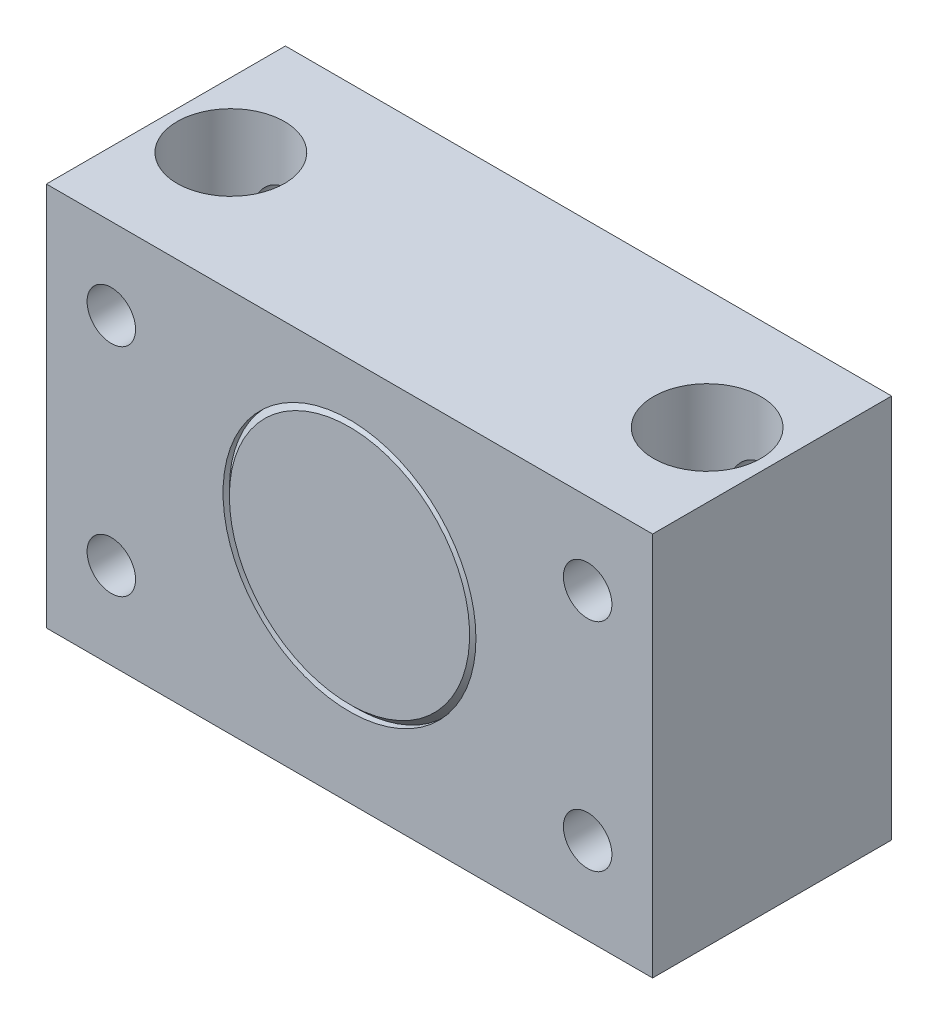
ISO-10303-21;
HEADER;
FILE_DESCRIPTION(('STEP AP214'),'2;1');
FILE_NAME('part.step','',(''),(''),'','','');
FILE_SCHEMA(('AUTOMOTIVE_DESIGN { 1 0 10303 214 1 1 1 1 }'));
ENDSEC;
DATA;
#1=APPLICATION_CONTEXT('core data for automotive mechanical design processes');
#2=APPLICATION_PROTOCOL_DEFINITION('international standard','automotive_design',2000,#1);
#3=PRODUCT_CONTEXT('',#1,'mechanical');
#4=PRODUCT('Part','Part','',(#3));
#5=PRODUCT_RELATED_PRODUCT_CATEGORY('part','',(#4));
#6=PRODUCT_DEFINITION_FORMATION('','',#4);
#7=PRODUCT_DEFINITION_CONTEXT('part definition',#1,'design');
#8=PRODUCT_DEFINITION('design','',#6,#7);
#9=PRODUCT_DEFINITION_SHAPE('','',#8);
#10=(LENGTH_UNIT() NAMED_UNIT(*) SI_UNIT(.MILLI.,.METRE.));
#11=(NAMED_UNIT(*) PLANE_ANGLE_UNIT() SI_UNIT($,.RADIAN.));
#12=(NAMED_UNIT(*) SI_UNIT($,.STERADIAN.) SOLID_ANGLE_UNIT());
#13=UNCERTAINTY_MEASURE_WITH_UNIT(LENGTH_MEASURE(1.E-05),#10,'distance_accuracy_value','');
#14=(GEOMETRIC_REPRESENTATION_CONTEXT(3) GLOBAL_UNCERTAINTY_ASSIGNED_CONTEXT((#13)) GLOBAL_UNIT_ASSIGNED_CONTEXT((#10,
#11,#12)) REPRESENTATION_CONTEXT('',''));
#15=CARTESIAN_POINT('',(0.,0.,0.));
#16=DIRECTION('',(0.,0.,1.));
#17=DIRECTION('',(1.,0.,0.));
#18=AXIS2_PLACEMENT_3D('',#15,#16,#17);
#19=CARTESIAN_POINT('',(44.45,30.1498,-35.052));
#20=DIRECTION('',(0.,0.,1.));
#21=DIRECTION('',(1.,0.,0.));
#22=AXIS2_PLACEMENT_3D('',#19,#20,#21);
#23=CYLINDRICAL_SURFACE('',#22,18.542);
#24=CARTESIAN_POINT('',(44.45,30.1498,-35.052));
#25=DIRECTION('',(0.,0.,1.));
#26=DIRECTION('',(1.,0.,0.));
#27=AXIS2_PLACEMENT_3D('',#24,#25,#26);
#28=CIRCLE('',#27,18.542);
#29=CARTESIAN_POINT('',(62.992,30.1498,-35.052));
#30=VERTEX_POINT('',#29);
#31=EDGE_CURVE('E271',#30,#30,#28,.T.);
#32=ORIENTED_EDGE('',*,*,#31,.F.);
#33=EDGE_LOOP('',(#32));
#34=FACE_BOUND('',#33,.T.);
#35=CARTESIAN_POINT('',(44.45,30.1498,-26.67));
#36=DIRECTION('',(0.,0.,1.));
#37=DIRECTION('',(1.,0.,0.));
#38=AXIS2_PLACEMENT_3D('',#35,#36,#37);
#39=CIRCLE('',#38,18.542);
#40=CARTESIAN_POINT('',(62.992,30.1498,-26.67));
#41=VERTEX_POINT('',#40);
#42=EDGE_CURVE('E11',#41,#41,#39,.F.);
#43=ORIENTED_EDGE('',*,*,#42,.F.);
#44=EDGE_LOOP('',(#43));
#45=FACE_BOUND('',#44,.T.);
#46=ADVANCED_FACE('F31',(#34,#45),#23,.F.);
#47=CARTESIAN_POINT('',(44.45,30.1498,0.));
#48=DIRECTION('',(0.,0.,1.));
#49=DIRECTION('',(1.,0.,0.));
#50=AXIS2_PLACEMENT_3D('',#47,#48,#49);
#51=CIRCLE('',#50,18.542);
#52=CARTESIAN_POINT('',(62.992,30.1498,0.));
#53=VERTEX_POINT('',#52);
#54=EDGE_CURVE('E267',#53,#53,#51,.T.);
#55=ORIENTED_EDGE('',*,*,#54,.T.);
#56=EDGE_LOOP('',(#55));
#57=FACE_BOUND('',#56,.T.);
#58=CARTESIAN_POINT('',(44.45,30.1498000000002,-0.927100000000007));
#59=DIRECTION('',(0.,0.,-1.));
#60=DIRECTION('',(-1.,0.,0.));
#61=AXIS2_PLACEMENT_3D('',#58,#59,#60);
#62=CIRCLE('',#61,18.542);
#63=CARTESIAN_POINT('',(25.908,30.1498000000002,-0.927100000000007));
#64=VERTEX_POINT('',#63);
#65=EDGE_CURVE('E253',#64,#64,#62,.F.);
#66=ORIENTED_EDGE('',*,*,#65,.F.);
#67=EDGE_LOOP('',(#66));
#68=FACE_BOUND('',#67,.T.);
#69=ADVANCED_FACE('F183',(#57,#68),#23,.F.);
#70=CARTESIAN_POINT('',(79.375,0.,-17.526));
#71=DIRECTION('',(0.,1.,0.));
#72=DIRECTION('',(0.,0.,1.));
#73=AXIS2_PLACEMENT_3D('',#70,#71,#72);
#74=CYLINDRICAL_SURFACE('',#73,5.20700000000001);
#75=CARTESIAN_POINT('',(79.375,9.144,-12.319));
#76=CARTESIAN_POINT('',(79.5527237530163,9.14400572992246,-12.3190051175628));
#77=CARTESIAN_POINT('',(79.7304825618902,9.15740223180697,-12.3281804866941));
#78=CARTESIAN_POINT('',(80.0803120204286,9.2101544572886,-12.3639879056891));
#79=CARTESIAN_POINT('',(80.2523790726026,9.24952628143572,-12.3906307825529));
#80=CARTESIAN_POINT('',(80.5852161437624,9.35176129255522,-12.4587547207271));
#81=CARTESIAN_POINT('',(80.7460366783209,9.41451018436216,-12.5001635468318));
#82=CARTESIAN_POINT('',(81.0541524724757,9.56078047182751,-12.5945405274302));
#83=CARTESIAN_POINT('',(81.2014460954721,9.64430437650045,-12.6475100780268));
#84=CARTESIAN_POINT('',(81.4927388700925,9.83757401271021,-12.7662861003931));
#85=CARTESIAN_POINT('',(81.6353470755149,9.94896457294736,-12.8328071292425));
#86=CARTESIAN_POINT('',(81.901198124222,10.1908520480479,-12.9703885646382));
#87=CARTESIAN_POINT('',(82.0244119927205,10.3213769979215,-13.0414555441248));
#88=CARTESIAN_POINT('',(82.2030287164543,10.5416896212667,-13.1532263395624));
#89=CARTESIAN_POINT('',(82.2653102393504,10.6258206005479,-13.1942561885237));
#90=CARTESIAN_POINT('',(82.3825184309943,10.7997409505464,-13.2747948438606));
#91=CARTESIAN_POINT('',(82.4374433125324,10.8895316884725,-13.3143032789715));
#92=CARTESIAN_POINT('',(82.5904537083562,11.1668831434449,-13.4284635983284));
#93=CARTESIAN_POINT('',(82.677137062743,11.3628666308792,-13.498988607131));
#94=CARTESIAN_POINT('',(82.7943200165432,11.7118853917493,-13.598510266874));
#95=CARTESIAN_POINT('',(82.8338732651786,11.8601661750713,-13.6336181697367));
#96=CARTESIAN_POINT('',(82.8936534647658,12.1633654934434,-13.687565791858));
#97=CARTESIAN_POINT('',(82.9139156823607,12.3182713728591,-13.7064351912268));
#98=CARTESIAN_POINT('',(82.9338100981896,12.6313586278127,-13.7249555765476));
#99=CARTESIAN_POINT('',(82.9333420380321,12.7895522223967,-13.7245131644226));
#100=CARTESIAN_POINT('',(82.9115620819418,13.1032759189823,-13.7042505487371));
#101=CARTESIAN_POINT('',(82.8902351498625,13.2588040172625,-13.6844163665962));
#102=CARTESIAN_POINT('',(82.8299287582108,13.5544986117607,-13.6301278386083));
#103=CARTESIAN_POINT('',(82.7919713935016,13.6950406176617,-13.596526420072));
#104=CARTESIAN_POINT('',(82.7004268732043,13.9678357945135,-13.5187575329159));
#105=CARTESIAN_POINT('',(82.6468275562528,14.1000824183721,-13.4745818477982));
#106=CARTESIAN_POINT('',(82.4953517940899,14.4184914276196,-13.3559311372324));
#107=CARTESIAN_POINT('',(82.3886908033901,14.5989431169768,-13.2772812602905));
#108=CARTESIAN_POINT('',(82.1466761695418,14.9374893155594,-13.1155660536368));
#109=CARTESIAN_POINT('',(82.0112684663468,15.0955407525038,-13.0324926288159));
#110=CARTESIAN_POINT('',(81.7123090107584,15.3881659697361,-12.8699212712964));
#111=CARTESIAN_POINT('',(81.5485128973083,15.5225135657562,-12.7904626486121));
#112=CARTESIAN_POINT('',(81.1959376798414,15.7617798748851,-12.6440656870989));
#113=CARTESIAN_POINT('',(81.0072114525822,15.8667594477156,-12.5771015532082));
#114=CARTESIAN_POINT('',(80.6530267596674,16.0227226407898,-12.4756988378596));
#115=CARTESIAN_POINT('',(80.4916866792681,16.0805174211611,-12.4373406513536));
#116=CARTESIAN_POINT('',(80.1596634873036,16.1726140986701,-12.3757012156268));
#117=CARTESIAN_POINT('',(79.9889867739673,16.2069318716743,-12.352409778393));
#118=CARTESIAN_POINT('',(79.6423456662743,16.2502486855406,-12.3229506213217));
#119=CARTESIAN_POINT('',(79.4663650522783,16.259159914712,-12.3168422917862));
#120=CARTESIAN_POINT('',(79.1153084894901,16.2508478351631,-12.3225181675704));
#121=CARTESIAN_POINT('',(78.9402325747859,16.2336235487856,-12.3343030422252));
#122=CARTESIAN_POINT('',(78.6059284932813,16.175756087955,-12.3735076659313));
#123=CARTESIAN_POINT('',(78.4463577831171,16.1364491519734,-12.4000344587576));
#124=CARTESIAN_POINT('',(78.1365706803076,16.0373492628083,-12.4659360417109));
#125=CARTESIAN_POINT('',(77.9863560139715,15.977552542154,-12.5053131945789));
#126=CARTESIAN_POINT('',(77.6863908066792,15.8342506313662,-12.5977143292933));
#127=CARTESIAN_POINT('',(77.5376216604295,15.7492414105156,-12.6515728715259));
#128=CARTESIAN_POINT('',(77.2558313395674,15.5606046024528,-12.7673003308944));
#129=CARTESIAN_POINT('',(77.122821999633,15.456963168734,-12.8291751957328));
#130=CARTESIAN_POINT('',(76.8527792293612,15.2143232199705,-12.9677149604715));
#131=CARTESIAN_POINT('',(76.7188303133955,15.0723098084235,-13.0451172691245));
#132=CARTESIAN_POINT('',(76.4754723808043,14.767822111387,-13.1986125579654));
#133=CARTESIAN_POINT('',(76.3660753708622,14.6053378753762,-13.2747048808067));
#134=CARTESIAN_POINT('',(76.1869113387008,14.2843996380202,-13.4077864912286));
#135=CARTESIAN_POINT('',(76.1137995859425,14.1283179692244,-13.465969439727));
#136=CARTESIAN_POINT('',(75.990041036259,13.8033040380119,-13.5685520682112));
#137=CARTESIAN_POINT('',(75.9393500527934,13.6343978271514,-13.6129788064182));
#138=CARTESIAN_POINT('',(75.8697135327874,13.316363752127,-13.6753325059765));
#139=CARTESIAN_POINT('',(75.8468405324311,13.1687438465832,-13.6964771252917));
#140=CARTESIAN_POINT('',(75.8199363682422,12.8703919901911,-13.7214318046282));
#141=CARTESIAN_POINT('',(75.815887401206,12.719663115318,-13.725258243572));
#142=CARTESIAN_POINT('',(75.8268934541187,12.41960709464,-13.7149855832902));
#143=CARTESIAN_POINT('',(75.8419421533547,12.270279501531,-13.7008924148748));
#144=CARTESIAN_POINT('',(75.8901146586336,11.9768902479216,-13.6569624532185));
#145=CARTESIAN_POINT('',(75.9232640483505,11.8328363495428,-13.627103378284));
#146=CARTESIAN_POINT('',(76.0190417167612,11.5085300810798,-13.5440988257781));
#147=CARTESIAN_POINT('',(76.0876696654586,11.331188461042,-13.4865793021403));
#148=CARTESIAN_POINT('',(76.2498927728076,10.9929069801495,-13.359810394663));
#149=CARTESIAN_POINT('',(76.3435257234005,10.8319924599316,-13.2905433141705));
#150=CARTESIAN_POINT('',(76.5556515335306,10.524688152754,-13.1463956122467));
#151=CARTESIAN_POINT('',(76.6746201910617,10.3786693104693,-13.0714282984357));
#152=CARTESIAN_POINT('',(76.9348719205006,10.1064835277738,-12.9237193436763));
#153=CARTESIAN_POINT('',(77.07616165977,9.98032254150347,-12.8509783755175));
#154=CARTESIAN_POINT('',(77.3138241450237,9.8002845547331,-12.7433898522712));
#155=CARTESIAN_POINT('',(77.4032169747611,9.73873315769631,-12.705752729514));
#156=CARTESIAN_POINT('',(77.5883041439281,9.62352053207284,-12.6341294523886));
#157=CARTESIAN_POINT('',(77.6839953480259,9.56985542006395,-12.6001415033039));
#158=CARTESIAN_POINT('',(77.8810582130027,9.47116193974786,-12.5368440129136));
#159=CARTESIAN_POINT('',(77.9824223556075,9.42612247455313,-12.5075284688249));
#160=CARTESIAN_POINT('',(78.1901349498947,9.34535331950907,-12.4544673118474));
#161=CARTESIAN_POINT('',(78.2964811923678,9.30961954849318,-12.4307192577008));
#162=CARTESIAN_POINT('',(78.5607684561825,9.23469438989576,-12.380618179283));
#163=CARTESIAN_POINT('',(78.7209320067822,9.20082650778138,-12.3576687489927));
#164=CARTESIAN_POINT('',(79.0457220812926,9.15548306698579,-12.3268616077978));
#165=CARTESIAN_POINT('',(79.2103459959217,9.14399469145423,-12.3189952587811));
#166=CARTESIAN_POINT('',(79.375,9.144,-12.319));
#167=B_SPLINE_CURVE_WITH_KNOTS('',3,(#75,#76,#77,#78,#79,#80,#81,#82,#83,#84,#85,#86,#87,#88,
#89,#90,#91,#92,#93,#94,#95,#96,#97,#98,#99,#100,#101,#102,#103,#104,#105,#106,#107,#108,#109,
#110,#111,#112,#113,#114,#115,#116,#117,#118,#119,#120,#121,#122,#123,#124,#125,#126,#127,#128,
#129,#130,#131,#132,#133,#134,#135,#136,#137,#138,#139,#140,#141,#142,#143,#144,#145,#146,#147,
#148,#149,#150,#151,#152,#153,#154,#155,#156,#157,#158,#159,#160,#161,#162,#163,#164,#165,#166),
.UNSPECIFIED.,.T.,.F.,(4,2,2,2,2,2,2,2,2,2,2,2,2,2,2,2,2,2,2,2,2,2,2,2,2,2,2,2,2,2,2,2,2,2,2,2,
2,2,2,2,2,2,2,2,2,4),(0.,0.532521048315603,1.06537248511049,1.59565218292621,2.12599595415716,
2.70228604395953,3.27942909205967,3.61635077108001,3.95335415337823,4.62552290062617,
5.09603705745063,5.56568938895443,6.0376133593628,6.50987776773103,6.9564821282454,
7.40343464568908,8.07160119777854,8.7410355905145,9.41654784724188,10.0906496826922,
10.6152943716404,11.1395839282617,11.6656833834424,12.1918025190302,12.6890662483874,
13.186421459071,13.7232162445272,14.2604116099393,14.8879416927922,15.5157779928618,
16.0595666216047,16.6022787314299,17.0528901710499,17.5030753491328,17.9531115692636,
18.4037855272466,18.9965828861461,19.5902813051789,20.1963066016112,20.8025132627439,
21.1467129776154,21.4907426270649,21.8343266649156,22.1777597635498,22.6714021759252,
23.1647617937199),.UNSPECIFIED.);
#168=CARTESIAN_POINT('',(79.375,9.144,-12.319));
#169=VERTEX_POINT('',#168);
#170=EDGE_CURVE('E193',#169,#169,#167,.T.);
#171=ORIENTED_EDGE('',*,*,#170,.T.);
#172=EDGE_LOOP('',(#171));
#173=FACE_BOUND('',#172,.T.);
#174=CARTESIAN_POINT('',(82.931,12.7,-21.3296446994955));
#175=CARTESIAN_POINT('',(82.9310037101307,12.6138817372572,-21.3296380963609));
#176=CARTESIAN_POINT('',(82.9278673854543,12.5277915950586,-21.3325797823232));
#177=CARTESIAN_POINT('',(82.9154045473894,12.3564203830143,-21.3441752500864));
#178=CARTESIAN_POINT('',(82.9060764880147,12.2711395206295,-21.3528304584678));
#179=CARTESIAN_POINT('',(82.8814079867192,12.1020419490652,-21.3754452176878));
#180=CARTESIAN_POINT('',(82.8660583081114,12.0182276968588,-21.3894129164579));
#181=CARTESIAN_POINT('',(82.8296360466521,11.8527615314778,-21.422015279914));
#182=CARTESIAN_POINT('',(82.8085604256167,11.7711107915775,-21.4406524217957));
#183=CARTESIAN_POINT('',(82.7377437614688,11.5318738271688,-21.5020122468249));
#184=CARTESIAN_POINT('',(82.6801127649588,11.3780291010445,-21.5504779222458));
#185=CARTESIAN_POINT('',(82.5460410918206,11.0825874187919,-21.6569391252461));
#186=CARTESIAN_POINT('',(82.4695977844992,10.9409921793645,-21.714935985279));
#187=CARTESIAN_POINT('',(82.2854330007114,10.6483855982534,-21.8453714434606));
#188=CARTESIAN_POINT('',(82.1746326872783,10.4996700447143,-21.9186146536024));
#189=CARTESIAN_POINT('',(81.9310239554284,10.2208549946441,-22.0646975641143));
#190=CARTESIAN_POINT('',(81.7981904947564,10.0907769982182,-22.137536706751));
#191=CARTESIAN_POINT('',(81.5724186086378,9.90212539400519,-22.2475138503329));
#192=CARTESIAN_POINT('',(81.4862802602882,9.8365312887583,-22.2867532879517));
#193=CARTESIAN_POINT('',(81.3074572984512,9.71293620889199,-22.3620994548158));
#194=CARTESIAN_POINT('',(81.2147756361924,9.65493184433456,-22.3982075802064));
#195=CARTESIAN_POINT('',(81.0233936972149,9.54722831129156,-22.4662371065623));
#196=CARTESIAN_POINT('',(80.9247009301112,9.49751905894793,-22.4981635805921));
#197=CARTESIAN_POINT('',(80.721888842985,9.40707397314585,-22.5568941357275));
#198=CARTESIAN_POINT('',(80.6177717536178,9.36633448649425,-22.5837003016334));
#199=CARTESIAN_POINT('',(80.3535107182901,9.27723626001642,-22.6427778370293));
#200=CARTESIAN_POINT('',(80.1905333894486,9.23465741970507,-22.6714636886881));
#201=CARTESIAN_POINT('',(79.8583600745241,9.17295959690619,-22.7132161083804));
#202=CARTESIAN_POINT('',(79.6891690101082,9.15382244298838,-22.7262947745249));
#203=CARTESIAN_POINT('',(79.3490023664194,9.14001816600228,-22.7357173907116));
#204=CARTESIAN_POINT('',(79.1780241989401,9.14539358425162,-22.7320322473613));
#205=CARTESIAN_POINT('',(78.8397389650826,9.18040163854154,-22.7081930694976));
#206=CARTESIAN_POINT('',(78.6724329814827,9.21004133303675,-22.6880342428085));
#207=CARTESIAN_POINT('',(78.3492155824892,9.29116495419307,-22.6335424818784));
#208=CARTESIAN_POINT('',(78.1931471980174,9.34221915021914,-22.5994887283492));
#209=CARTESIAN_POINT('',(77.8920652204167,9.46388585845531,-22.5198000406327));
#210=CARTESIAN_POINT('',(77.747053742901,9.53450210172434,-22.4741628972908));
#211=CARTESIAN_POINT('',(77.4544778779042,9.70195655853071,-22.3686512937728));
#212=CARTESIAN_POINT('',(77.3084670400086,9.80085287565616,-22.307752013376));
#213=CARTESIAN_POINT('',(77.034133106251,10.0174475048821,-22.1796188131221));
#214=CARTESIAN_POINT('',(76.9058305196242,10.1351672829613,-22.1123776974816));
#215=CARTESIAN_POINT('',(76.6477313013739,10.4090670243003,-21.9645301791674));
#216=CARTESIAN_POINT('',(76.5214293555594,10.568381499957,-21.8836041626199));
#217=CARTESIAN_POINT('',(76.2966424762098,10.9082561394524,-21.7278131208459));
#218=CARTESIAN_POINT('',(76.1981438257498,11.0888057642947,-21.6529451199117));
#219=CARTESIAN_POINT('',(76.051842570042,11.4245305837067,-21.5355047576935));
#220=CARTESIAN_POINT('',(75.9975605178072,11.5756216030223,-21.4894813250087));
#221=CARTESIAN_POINT('',(75.9314222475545,11.8092341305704,-21.4318252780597));
#222=CARTESIAN_POINT('',(75.9119276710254,11.8882395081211,-21.4145070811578));
#223=CARTESIAN_POINT('',(75.8782934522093,12.0481956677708,-21.3842905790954));
#224=CARTESIAN_POINT('',(75.864151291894,12.1291455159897,-21.37139019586));
#225=CARTESIAN_POINT('',(75.8413632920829,12.2932196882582,-21.3504612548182));
#226=CARTESIAN_POINT('',(75.8327693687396,12.3763571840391,-21.3424787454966));
#227=CARTESIAN_POINT('',(75.8214675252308,12.5433408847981,-21.3319580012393));
#228=CARTESIAN_POINT('',(75.8187569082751,12.6271867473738,-21.3294172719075));
#229=CARTESIAN_POINT('',(75.8192772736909,12.7948632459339,-21.329904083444));
#230=CARTESIAN_POINT('',(75.8225093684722,12.8786938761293,-21.3329326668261));
#231=CARTESIAN_POINT('',(75.8348367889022,13.0455250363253,-21.3443973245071));
#232=CARTESIAN_POINT('',(75.8439319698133,13.1285255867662,-21.3528332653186));
#233=CARTESIAN_POINT('',(75.8769368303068,13.3558350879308,-21.3831038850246));
#234=CARTESIAN_POINT('',(75.9068547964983,13.4986189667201,-21.4102505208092));
#235=CARTESIAN_POINT('',(75.9828566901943,13.7767438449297,-21.4767885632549));
#236=CARTESIAN_POINT('',(76.0289558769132,13.9120776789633,-21.5161915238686));
#237=CARTESIAN_POINT('',(76.1601830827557,14.2337944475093,-21.6232961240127));
#238=CARTESIAN_POINT('',(76.2535209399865,14.4152761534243,-21.6957045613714));
#239=CARTESIAN_POINT('',(76.4678481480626,14.757806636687,-21.8478798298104));
#240=CARTESIAN_POINT('',(76.588889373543,14.9188161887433,-21.9276602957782));
#241=CARTESIAN_POINT('',(76.8586091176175,15.2208071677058,-22.0873124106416));
#242=CARTESIAN_POINT('',(77.0076713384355,15.3614556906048,-22.1671678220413));
#243=CARTESIAN_POINT('',(77.3303821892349,15.6166508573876,-22.3180778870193));
#244=CARTESIAN_POINT('',(77.5039918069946,15.731238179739,-22.3891461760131));
#245=CARTESIAN_POINT('',(77.8409815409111,15.91277232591,-22.5045167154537));
#246=CARTESIAN_POINT('',(78.0009004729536,15.9845370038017,-22.5513239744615));
#247=CARTESIAN_POINT('',(78.3327845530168,16.1044065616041,-22.6304745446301));
#248=CARTESIAN_POINT('',(78.5047419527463,16.1525265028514,-22.6628270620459));
#249=CARTESIAN_POINT('',(78.857197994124,16.2227035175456,-22.7102526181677));
#250=CARTESIAN_POINT('',(79.0377348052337,16.244629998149,-22.7252390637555));
#251=CARTESIAN_POINT('',(79.4006054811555,16.2605379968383,-22.7360963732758));
#252=CARTESIAN_POINT('',(79.5829388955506,16.2545263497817,-22.7319719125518));
#253=CARTESIAN_POINT('',(79.9279826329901,16.2166661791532,-22.706202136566));
#254=CARTESIAN_POINT('',(80.0910574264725,16.1870238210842,-22.6860532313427));
#255=CARTESIAN_POINT('',(80.4093160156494,16.1062146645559,-22.6317925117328));
#256=CARTESIAN_POINT('',(80.5644981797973,16.0550434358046,-22.5976778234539));
#257=CARTESIAN_POINT('',(80.8710422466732,15.9304313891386,-22.5160976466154));
#258=CARTESIAN_POINT('',(81.0218640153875,15.8560402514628,-22.4680703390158));
#259=CARTESIAN_POINT('',(81.3091855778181,15.68860195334,-22.3628600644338));
#260=CARTESIAN_POINT('',(81.4456819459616,15.5955503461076,-22.3056749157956));
#261=CARTESIAN_POINT('',(81.723350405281,15.377004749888,-22.1762798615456));
#262=CARTESIAN_POINT('',(81.8618701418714,15.2487091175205,-22.1031223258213));
#263=CARTESIAN_POINT('',(82.1169340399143,14.9720948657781,-21.9550423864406));
#264=CARTESIAN_POINT('',(82.2334282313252,14.8237319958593,-21.8801163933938));
#265=CARTESIAN_POINT('',(82.3972910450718,14.576811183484,-21.7667367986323));
#266=CARTESIAN_POINT('',(82.4527990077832,14.4843815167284,-21.7264942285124));
#267=CARTESIAN_POINT('',(82.5556845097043,14.2937730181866,-21.6491335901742));
#268=CARTESIAN_POINT('',(82.6030596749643,14.1955925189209,-21.6120164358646));
#269=CARTESIAN_POINT('',(82.6889328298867,13.9941885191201,-21.5426825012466));
#270=CARTESIAN_POINT('',(82.7274615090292,13.8909840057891,-21.5104489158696));
#271=CARTESIAN_POINT('',(82.7951344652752,13.679842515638,-21.452514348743));
#272=CARTESIAN_POINT('',(82.8242869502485,13.5719097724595,-21.4268076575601));
#273=CARTESIAN_POINT('',(82.8755029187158,13.3384404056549,-21.3809538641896));
#274=CARTESIAN_POINT('',(82.896230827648,13.2123858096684,-21.3618983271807));
#275=CARTESIAN_POINT('',(82.9239721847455,12.9575319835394,-21.3362526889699));
#276=CARTESIAN_POINT('',(82.9309944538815,12.8287345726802,-21.3296545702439));
#277=CARTESIAN_POINT('',(82.931,12.7,-21.3296446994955));
#278=B_SPLINE_CURVE_WITH_KNOTS('',3,(#174,#175,#176,#177,#178,#179,#180,#181,#182,#183,#184,
#185,#186,#187,#188,#189,#190,#191,#192,#193,#194,#195,#196,#197,#198,#199,#200,#201,#202,#203,
#204,#205,#206,#207,#208,#209,#210,#211,#212,#213,#214,#215,#216,#217,#218,#219,#220,#221,#222,
#223,#224,#225,#226,#227,#228,#229,#230,#231,#232,#233,#234,#235,#236,#237,#238,#239,#240,#241,
#242,#243,#244,#245,#246,#247,#248,#249,#250,#251,#252,#253,#254,#255,#256,#257,#258,#259,#260,
#261,#262,#263,#264,#265,#266,#267,#268,#269,#270,#271,#272,#273,#274,#275,#276,#277),
.UNSPECIFIED.,.T.,.F.,(4,2,2,2,2,2,2,2,2,2,2,2,2,2,2,2,2,2,2,2,2,2,2,2,2,2,2,2,2,2,2,2,2,2,2,2,
2,2,2,2,2,2,2,2,2,2,2,2,2,2,2,4),(0.,0.258200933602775,0.516466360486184,0.775129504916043,
1.03393016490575,1.54555575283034,2.05725292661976,2.65330486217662,3.25003895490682,
3.59511439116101,3.94003517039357,4.28453354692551,4.62889135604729,5.13909486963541,
5.64890263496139,6.15959550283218,6.67043698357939,7.17148375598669,7.67262615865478,
8.23023782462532,8.78848997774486,9.4421831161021,10.0955531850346,10.5945463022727,
10.8438728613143,11.0930819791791,11.3445904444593,11.595983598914,11.8474238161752,
12.0988578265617,12.5420706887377,12.9857026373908,13.6318686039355,14.2792545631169,
14.9362536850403,15.592220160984,16.1342458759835,16.675925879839,17.2202954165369,
17.7645317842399,18.2631850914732,18.7619410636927,19.2846165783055,19.8074167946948,
20.4125964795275,21.0191330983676,21.3639872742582,21.7089419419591,22.0526812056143,
22.3961187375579,22.7823411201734,23.1683148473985),.UNSPECIFIED.);
#279=CARTESIAN_POINT('',(82.931,12.7,-21.3296446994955));
#280=VERTEX_POINT('',#279);
#281=EDGE_CURVE('E187',#280,#280,#278,.T.);
#282=ORIENTED_EDGE('',*,*,#281,.T.);
#283=EDGE_LOOP('',(#282));
#284=FACE_BOUND('',#283,.T.);
#285=CARTESIAN_POINT('',(79.375,0.,-17.526));
#286=DIRECTION('',(0.,1.,0.));
#287=DIRECTION('',(0.,0.,1.));
#288=AXIS2_PLACEMENT_3D('',#285,#286,#287);
#289=CIRCLE('',#288,5.20700000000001);
#290=CARTESIAN_POINT('',(79.375,0.,-12.319));
#291=VERTEX_POINT('',#290);
#292=EDGE_CURVE('E102',#291,#291,#289,.T.);
#293=ORIENTED_EDGE('',*,*,#292,.F.);
#294=EDGE_LOOP('',(#293));
#295=FACE_BOUND('',#294,.T.);
#296=CARTESIAN_POINT('',(79.375,30.988,-17.526));
#297=DIRECTION('',(0.,1.,0.));
#298=DIRECTION('',(0.,0.,1.));
#299=AXIS2_PLACEMENT_3D('',#296,#297,#298);
#300=CIRCLE('',#299,5.20700000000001);
#301=CARTESIAN_POINT('',(79.375,30.988,-12.319));
#302=VERTEX_POINT('',#301);
#303=EDGE_CURVE('E115',#302,#302,#300,.F.);
#304=ORIENTED_EDGE('',*,*,#303,.F.);
#305=EDGE_LOOP('',(#304));
#306=FACE_BOUND('',#305,.T.);
#307=ADVANCED_FACE('F201',(#173,#284,#295,#306),#74,.F.);
#308=CARTESIAN_POINT('',(9.52500000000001,0.,-17.526));
#309=DIRECTION('',(0.,1.,0.));
#310=DIRECTION('',(0.,0.,1.));
#311=AXIS2_PLACEMENT_3D('',#308,#309,#310);
#312=CYLINDRICAL_SURFACE('',#311,5.207);
#313=CARTESIAN_POINT('',(9.52500000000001,9.144,-12.319));
#314=CARTESIAN_POINT('',(9.70272375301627,9.14400572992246,-12.3190051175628));
#315=CARTESIAN_POINT('',(9.88048256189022,9.15740223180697,-12.3281804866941));
#316=CARTESIAN_POINT('',(10.2303120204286,9.2101544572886,-12.3639879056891));
#317=CARTESIAN_POINT('',(10.4023790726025,9.24952628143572,-12.3906307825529));
#318=CARTESIAN_POINT('',(10.7352161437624,9.35176129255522,-12.4587547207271));
#319=CARTESIAN_POINT('',(10.8960366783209,9.41451018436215,-12.5001635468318));
#320=CARTESIAN_POINT('',(11.2041524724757,9.5607804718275,-12.5945405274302));
#321=CARTESIAN_POINT('',(11.3514460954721,9.64430437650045,-12.6475100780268));
#322=CARTESIAN_POINT('',(11.6427388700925,9.8375740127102,-12.7662861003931));
#323=CARTESIAN_POINT('',(11.7853470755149,9.94896457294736,-12.8328071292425));
#324=CARTESIAN_POINT('',(12.051198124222,10.1908520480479,-12.9703885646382));
#325=CARTESIAN_POINT('',(12.1744119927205,10.3213769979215,-13.0414555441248));
#326=CARTESIAN_POINT('',(12.3530287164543,10.5416896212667,-13.1532263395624));
#327=CARTESIAN_POINT('',(12.4153102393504,10.6258206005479,-13.1942561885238));
#328=CARTESIAN_POINT('',(12.5325184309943,10.7997409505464,-13.2747948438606));
#329=CARTESIAN_POINT('',(12.5874433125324,10.8895316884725,-13.3143032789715));
#330=CARTESIAN_POINT('',(12.7404537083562,11.1668831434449,-13.4284635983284));
#331=CARTESIAN_POINT('',(12.827137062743,11.3628666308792,-13.498988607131));
#332=CARTESIAN_POINT('',(12.9443200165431,11.7118853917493,-13.598510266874));
#333=CARTESIAN_POINT('',(12.9838732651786,11.8601661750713,-13.6336181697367));
#334=CARTESIAN_POINT('',(13.0436534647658,12.1633654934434,-13.687565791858));
#335=CARTESIAN_POINT('',(13.0639156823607,12.3182713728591,-13.7064351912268));
#336=CARTESIAN_POINT('',(13.0838100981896,12.6313586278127,-13.7249555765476));
#337=CARTESIAN_POINT('',(13.0833420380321,12.7895522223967,-13.7245131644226));
#338=CARTESIAN_POINT('',(13.0615620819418,13.1032759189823,-13.7042505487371));
#339=CARTESIAN_POINT('',(13.0402351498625,13.2588040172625,-13.6844163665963));
#340=CARTESIAN_POINT('',(12.9799287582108,13.5544986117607,-13.6301278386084));
#341=CARTESIAN_POINT('',(12.9419713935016,13.6950406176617,-13.596526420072));
#342=CARTESIAN_POINT('',(12.8504268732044,13.9678357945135,-13.5187575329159));
#343=CARTESIAN_POINT('',(12.7968275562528,14.1000824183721,-13.4745818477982));
#344=CARTESIAN_POINT('',(12.6453517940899,14.4184914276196,-13.3559311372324));
#345=CARTESIAN_POINT('',(12.5386908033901,14.5989431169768,-13.2772812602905));
#346=CARTESIAN_POINT('',(12.2966761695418,14.9374893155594,-13.1155660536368));
#347=CARTESIAN_POINT('',(12.1612684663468,15.0955407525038,-13.0324926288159));
#348=CARTESIAN_POINT('',(11.8623090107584,15.3881659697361,-12.8699212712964));
#349=CARTESIAN_POINT('',(11.6985128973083,15.5225135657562,-12.7904626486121));
#350=CARTESIAN_POINT('',(11.3459376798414,15.7617798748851,-12.6440656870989));
#351=CARTESIAN_POINT('',(11.1572114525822,15.8667594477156,-12.5771015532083));
#352=CARTESIAN_POINT('',(10.8030267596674,16.0227226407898,-12.4756988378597));
#353=CARTESIAN_POINT('',(10.6416866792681,16.0805174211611,-12.4373406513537));
#354=CARTESIAN_POINT('',(10.3096634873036,16.1726140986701,-12.3757012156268));
#355=CARTESIAN_POINT('',(10.1389867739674,16.2069318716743,-12.352409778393));
#356=CARTESIAN_POINT('',(9.7923456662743,16.2502486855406,-12.3229506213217));
#357=CARTESIAN_POINT('',(9.61636505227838,16.259159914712,-12.3168422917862));
#358=CARTESIAN_POINT('',(9.26530848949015,16.2508478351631,-12.3225181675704));
#359=CARTESIAN_POINT('',(9.09023257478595,16.2336235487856,-12.3343030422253));
#360=CARTESIAN_POINT('',(8.75592849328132,16.175756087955,-12.3735076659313));
#361=CARTESIAN_POINT('',(8.5963577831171,16.1364491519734,-12.4000344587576));
#362=CARTESIAN_POINT('',(8.28657068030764,16.0373492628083,-12.4659360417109));
#363=CARTESIAN_POINT('',(8.13635601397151,15.977552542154,-12.5053131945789));
#364=CARTESIAN_POINT('',(7.83639080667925,15.8342506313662,-12.5977143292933));
#365=CARTESIAN_POINT('',(7.68762166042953,15.7492414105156,-12.6515728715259));
#366=CARTESIAN_POINT('',(7.40583133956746,15.5606046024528,-12.7673003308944));
#367=CARTESIAN_POINT('',(7.27282199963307,15.456963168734,-12.8291751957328));
#368=CARTESIAN_POINT('',(7.00277922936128,15.2143232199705,-12.9677149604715));
#369=CARTESIAN_POINT('',(6.86883031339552,15.0723098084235,-13.0451172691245));
#370=CARTESIAN_POINT('',(6.62547238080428,14.767822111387,-13.1986125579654));
#371=CARTESIAN_POINT('',(6.51607537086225,14.6053378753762,-13.2747048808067));
#372=CARTESIAN_POINT('',(6.3369113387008,14.2843996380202,-13.4077864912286));
#373=CARTESIAN_POINT('',(6.26379958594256,14.1283179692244,-13.465969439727));
#374=CARTESIAN_POINT('',(6.14004103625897,13.803304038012,-13.5685520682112));
#375=CARTESIAN_POINT('',(6.0893500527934,13.6343978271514,-13.6129788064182));
#376=CARTESIAN_POINT('',(6.01971353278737,13.316363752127,-13.6753325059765));
#377=CARTESIAN_POINT('',(5.99684053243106,13.1687438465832,-13.6964771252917));
#378=CARTESIAN_POINT('',(5.96993636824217,12.8703919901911,-13.7214318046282));
#379=CARTESIAN_POINT('',(5.96588740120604,12.719663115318,-13.7252582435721));
#380=CARTESIAN_POINT('',(5.9768934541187,12.41960709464,-13.7149855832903));
#381=CARTESIAN_POINT('',(5.99194215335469,12.270279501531,-13.7008924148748));
#382=CARTESIAN_POINT('',(6.04011465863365,11.9768902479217,-13.6569624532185));
#383=CARTESIAN_POINT('',(6.07326404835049,11.8328363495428,-13.627103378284));
#384=CARTESIAN_POINT('',(6.16904171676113,11.5085300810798,-13.5440988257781));
#385=CARTESIAN_POINT('',(6.23766966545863,11.331188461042,-13.4865793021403));
#386=CARTESIAN_POINT('',(6.39989277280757,10.9929069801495,-13.3598103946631));
#387=CARTESIAN_POINT('',(6.49352572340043,10.8319924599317,-13.2905433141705));
#388=CARTESIAN_POINT('',(6.70565153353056,10.524688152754,-13.1463956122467));
#389=CARTESIAN_POINT('',(6.8246201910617,10.3786693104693,-13.0714282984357));
#390=CARTESIAN_POINT('',(7.08487192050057,10.1064835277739,-12.9237193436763));
#391=CARTESIAN_POINT('',(7.22616165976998,9.9803225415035,-12.8509783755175));
#392=CARTESIAN_POINT('',(7.4638241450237,9.80028455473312,-12.7433898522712));
#393=CARTESIAN_POINT('',(7.55321697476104,9.73873315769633,-12.705752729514));
#394=CARTESIAN_POINT('',(7.73830414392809,9.62352053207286,-12.6341294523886));
#395=CARTESIAN_POINT('',(7.83399534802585,9.56985542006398,-12.600141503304));
#396=CARTESIAN_POINT('',(8.03105821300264,9.47116193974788,-12.5368440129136));
#397=CARTESIAN_POINT('',(8.13242235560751,9.42612247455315,-12.5075284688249));
#398=CARTESIAN_POINT('',(8.34013494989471,9.34535331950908,-12.4544673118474));
#399=CARTESIAN_POINT('',(8.44648119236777,9.30961954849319,-12.4307192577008));
#400=CARTESIAN_POINT('',(8.71076845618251,9.23469438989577,-12.380618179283));
#401=CARTESIAN_POINT('',(8.87093200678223,9.20082650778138,-12.3576687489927));
#402=CARTESIAN_POINT('',(9.19572208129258,9.15548306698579,-12.3268616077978));
#403=CARTESIAN_POINT('',(9.36034599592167,9.14399469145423,-12.3189952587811));
#404=CARTESIAN_POINT('',(9.52500000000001,9.144,-12.319));
#405=B_SPLINE_CURVE_WITH_KNOTS('',3,(#313,#314,#315,#316,#317,#318,#319,#320,#321,#322,#323,
#324,#325,#326,#327,#328,#329,#330,#331,#332,#333,#334,#335,#336,#337,#338,#339,#340,#341,#342,
#343,#344,#345,#346,#347,#348,#349,#350,#351,#352,#353,#354,#355,#356,#357,#358,#359,#360,#361,
#362,#363,#364,#365,#366,#367,#368,#369,#370,#371,#372,#373,#374,#375,#376,#377,#378,#379,#380,
#381,#382,#383,#384,#385,#386,#387,#388,#389,#390,#391,#392,#393,#394,#395,#396,#397,#398,#399,
#400,#401,#402,#403,#404),.UNSPECIFIED.,.T.,.F.,(4,2,2,2,2,2,2,2,2,2,2,2,2,2,2,2,2,2,2,2,2,2,2,
2,2,2,2,2,2,2,2,2,2,2,2,2,2,2,2,2,2,2,2,2,2,4),(0.,0.532521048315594,1.06537248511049,
1.59565218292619,2.12599595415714,2.70228604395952,3.27942909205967,3.61635077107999,
3.95335415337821,4.62552290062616,5.09603705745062,5.56568938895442,6.03761335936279,
6.50987776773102,6.95648212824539,7.40343464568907,8.07160119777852,8.74103559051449,
9.41654784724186,10.0906496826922,10.6152943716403,11.1395839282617,11.6656833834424,
12.1918025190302,12.6890662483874,13.1864214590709,13.7232162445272,14.2604116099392,
14.8879416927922,15.5157779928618,16.0595666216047,16.6022787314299,17.0528901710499,
17.5030753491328,17.9531115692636,18.4037855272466,18.9965828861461,19.5902813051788,
20.1963066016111,20.8025132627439,21.1467129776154,21.4907426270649,21.8343266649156,
22.1777597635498,22.6714021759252,23.1647617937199),.UNSPECIFIED.);
#406=CARTESIAN_POINT('',(9.52500000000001,9.144,-12.319));
#407=VERTEX_POINT('',#406);
#408=EDGE_CURVE('E296',#407,#407,#405,.T.);
#409=ORIENTED_EDGE('',*,*,#408,.T.);
#410=EDGE_LOOP('',(#409));
#411=FACE_BOUND('',#410,.T.);
#412=CARTESIAN_POINT('',(13.081,12.7,-21.3296446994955));
#413=CARTESIAN_POINT('',(13.0810037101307,12.6138817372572,-21.3296380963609));
#414=CARTESIAN_POINT('',(13.0778673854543,12.5277915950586,-21.3325797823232));
#415=CARTESIAN_POINT('',(13.0654045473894,12.3564203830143,-21.3441752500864));
#416=CARTESIAN_POINT('',(13.0560764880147,12.2711395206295,-21.3528304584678));
#417=CARTESIAN_POINT('',(13.0314079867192,12.1020419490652,-21.3754452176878));
#418=CARTESIAN_POINT('',(13.0160583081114,12.0182276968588,-21.3894129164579));
#419=CARTESIAN_POINT('',(12.9796360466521,11.8527615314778,-21.422015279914));
#420=CARTESIAN_POINT('',(12.9585604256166,11.7711107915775,-21.4406524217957));
#421=CARTESIAN_POINT('',(12.8877437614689,11.5318738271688,-21.5020122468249));
#422=CARTESIAN_POINT('',(12.8301127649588,11.3780291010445,-21.5504779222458));
#423=CARTESIAN_POINT('',(12.6960410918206,11.0825874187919,-21.6569391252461));
#424=CARTESIAN_POINT('',(12.6195977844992,10.9409921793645,-21.714935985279));
#425=CARTESIAN_POINT('',(12.4354330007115,10.6483855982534,-21.8453714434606));
#426=CARTESIAN_POINT('',(12.3246326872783,10.4996700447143,-21.9186146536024));
#427=CARTESIAN_POINT('',(12.0810239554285,10.2208549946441,-22.0646975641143));
#428=CARTESIAN_POINT('',(11.9481904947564,10.0907769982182,-22.137536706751));
#429=CARTESIAN_POINT('',(11.7224186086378,9.90212539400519,-22.2475138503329));
#430=CARTESIAN_POINT('',(11.6362802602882,9.83653128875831,-22.2867532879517));
#431=CARTESIAN_POINT('',(11.4574572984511,9.71293620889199,-22.3620994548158));
#432=CARTESIAN_POINT('',(11.3647756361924,9.65493184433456,-22.3982075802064));
#433=CARTESIAN_POINT('',(11.1733936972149,9.54722831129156,-22.4662371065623));
#434=CARTESIAN_POINT('',(11.0747009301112,9.49751905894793,-22.4981635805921));
#435=CARTESIAN_POINT('',(10.871888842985,9.40707397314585,-22.5568941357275));
#436=CARTESIAN_POINT('',(10.7677717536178,9.36633448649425,-22.5837003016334));
#437=CARTESIAN_POINT('',(10.5035107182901,9.27723626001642,-22.6427778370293));
#438=CARTESIAN_POINT('',(10.3405333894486,9.23465741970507,-22.6714636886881));
#439=CARTESIAN_POINT('',(10.0083600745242,9.17295959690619,-22.7132161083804));
#440=CARTESIAN_POINT('',(9.83916901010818,9.15382244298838,-22.7262947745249));
#441=CARTESIAN_POINT('',(9.49900236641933,9.14001816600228,-22.7357173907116));
#442=CARTESIAN_POINT('',(9.32802419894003,9.14539358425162,-22.7320322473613));
#443=CARTESIAN_POINT('',(8.98973896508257,9.18040163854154,-22.7081930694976));
#444=CARTESIAN_POINT('',(8.82243298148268,9.21004133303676,-22.6880342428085));
#445=CARTESIAN_POINT('',(8.49921558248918,9.29116495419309,-22.6335424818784));
#446=CARTESIAN_POINT('',(8.34314719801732,9.34221915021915,-22.5994887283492));
#447=CARTESIAN_POINT('',(8.04206522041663,9.46388585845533,-22.5198000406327));
#448=CARTESIAN_POINT('',(7.89705374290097,9.53450210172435,-22.4741628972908));
#449=CARTESIAN_POINT('',(7.60447787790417,9.70195655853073,-22.3686512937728));
#450=CARTESIAN_POINT('',(7.45846704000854,9.80085287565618,-22.307752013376));
#451=CARTESIAN_POINT('',(7.18413310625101,10.0174475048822,-22.1796188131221));
#452=CARTESIAN_POINT('',(7.05583051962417,10.1351672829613,-22.1123776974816));
#453=CARTESIAN_POINT('',(6.7977313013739,10.4090670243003,-21.9645301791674));
#454=CARTESIAN_POINT('',(6.67142935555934,10.568381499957,-21.8836041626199));
#455=CARTESIAN_POINT('',(6.44664247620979,10.9082561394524,-21.7278131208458));
#456=CARTESIAN_POINT('',(6.34814382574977,11.0888057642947,-21.6529451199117));
#457=CARTESIAN_POINT('',(6.20184257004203,11.4245305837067,-21.5355047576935));
#458=CARTESIAN_POINT('',(6.14756051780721,11.5756216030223,-21.4894813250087));
#459=CARTESIAN_POINT('',(6.08142224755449,11.8092341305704,-21.4318252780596));
#460=CARTESIAN_POINT('',(6.06192767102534,11.8882395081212,-21.4145070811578));
#461=CARTESIAN_POINT('',(6.02829345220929,12.0481956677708,-21.3842905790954));
#462=CARTESIAN_POINT('',(6.01415129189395,12.1291455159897,-21.37139019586));
#463=CARTESIAN_POINT('',(5.99136329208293,12.2932196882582,-21.3504612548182));
#464=CARTESIAN_POINT('',(5.98276936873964,12.3763571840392,-21.3424787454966));
#465=CARTESIAN_POINT('',(5.97146752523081,12.5433408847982,-21.3319580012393));
#466=CARTESIAN_POINT('',(5.96875690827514,12.6271867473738,-21.3294172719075));
#467=CARTESIAN_POINT('',(5.96927727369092,12.7948632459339,-21.329904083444));
#468=CARTESIAN_POINT('',(5.97250936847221,12.8786938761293,-21.3329326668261));
#469=CARTESIAN_POINT('',(5.98483678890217,13.0455250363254,-21.3443973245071));
#470=CARTESIAN_POINT('',(5.99393196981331,13.1285255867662,-21.3528332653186));
#471=CARTESIAN_POINT('',(6.02693683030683,13.3558350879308,-21.3831038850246));
#472=CARTESIAN_POINT('',(6.05685479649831,13.4986189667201,-21.4102505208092));
#473=CARTESIAN_POINT('',(6.13285669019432,13.7767438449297,-21.4767885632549));
#474=CARTESIAN_POINT('',(6.17895587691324,13.9120776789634,-21.5161915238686));
#475=CARTESIAN_POINT('',(6.3101830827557,14.2337944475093,-21.6232961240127));
#476=CARTESIAN_POINT('',(6.40352093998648,14.4152761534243,-21.6957045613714));
#477=CARTESIAN_POINT('',(6.61784814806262,14.757806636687,-21.8478798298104));
#478=CARTESIAN_POINT('',(6.73888937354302,14.9188161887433,-21.9276602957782));
#479=CARTESIAN_POINT('',(7.00860911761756,15.2208071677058,-22.0873124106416));
#480=CARTESIAN_POINT('',(7.15767133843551,15.3614556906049,-22.1671678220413));
#481=CARTESIAN_POINT('',(7.48038218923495,15.6166508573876,-22.3180778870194));
#482=CARTESIAN_POINT('',(7.65399180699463,15.7312381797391,-22.3891461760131));
#483=CARTESIAN_POINT('',(7.99098154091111,15.91277232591,-22.5045167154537));
#484=CARTESIAN_POINT('',(8.15090047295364,15.9845370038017,-22.5513239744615));
#485=CARTESIAN_POINT('',(8.48278455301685,16.1044065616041,-22.6304745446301));
#486=CARTESIAN_POINT('',(8.65474195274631,16.1525265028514,-22.6628270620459));
#487=CARTESIAN_POINT('',(9.00719799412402,16.2227035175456,-22.7102526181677));
#488=CARTESIAN_POINT('',(9.18773480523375,16.2446299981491,-22.7252390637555));
#489=CARTESIAN_POINT('',(9.55060548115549,16.2605379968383,-22.7360963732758));
#490=CARTESIAN_POINT('',(9.73293889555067,16.2545263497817,-22.7319719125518));
#491=CARTESIAN_POINT('',(10.0779826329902,16.2166661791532,-22.706202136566));
#492=CARTESIAN_POINT('',(10.2410574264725,16.1870238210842,-22.6860532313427));
#493=CARTESIAN_POINT('',(10.5593160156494,16.1062146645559,-22.6317925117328));
#494=CARTESIAN_POINT('',(10.7144981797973,16.0550434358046,-22.5976778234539));
#495=CARTESIAN_POINT('',(11.0210422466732,15.9304313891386,-22.5160976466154));
#496=CARTESIAN_POINT('',(11.1718640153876,15.8560402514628,-22.4680703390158));
#497=CARTESIAN_POINT('',(11.4591855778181,15.68860195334,-22.3628600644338));
#498=CARTESIAN_POINT('',(11.5956819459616,15.5955503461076,-22.3056749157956));
#499=CARTESIAN_POINT('',(11.873350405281,15.377004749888,-22.1762798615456));
#500=CARTESIAN_POINT('',(12.0118701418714,15.2487091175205,-22.1031223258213));
#501=CARTESIAN_POINT('',(12.2669340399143,14.9720948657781,-21.9550423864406));
#502=CARTESIAN_POINT('',(12.3834282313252,14.8237319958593,-21.8801163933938));
#503=CARTESIAN_POINT('',(12.5472910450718,14.576811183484,-21.7667367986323));
#504=CARTESIAN_POINT('',(12.6027990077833,14.4843815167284,-21.7264942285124));
#505=CARTESIAN_POINT('',(12.7056845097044,14.2937730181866,-21.6491335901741));
#506=CARTESIAN_POINT('',(12.7530596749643,14.1955925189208,-21.6120164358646));
#507=CARTESIAN_POINT('',(12.8389328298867,13.99418851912,-21.5426825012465));
#508=CARTESIAN_POINT('',(12.8774615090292,13.890984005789,-21.5104489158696));
#509=CARTESIAN_POINT('',(12.9451344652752,13.679842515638,-21.452514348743));
#510=CARTESIAN_POINT('',(12.9742869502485,13.5719097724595,-21.4268076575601));
#511=CARTESIAN_POINT('',(13.0255029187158,13.3384404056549,-21.3809538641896));
#512=CARTESIAN_POINT('',(13.046230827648,13.2123858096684,-21.3618983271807));
#513=CARTESIAN_POINT('',(13.0739721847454,12.9575319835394,-21.3362526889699));
#514=CARTESIAN_POINT('',(13.0809944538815,12.8287345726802,-21.3296545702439));
#515=CARTESIAN_POINT('',(13.081,12.7,-21.3296446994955));
#516=B_SPLINE_CURVE_WITH_KNOTS('',3,(#412,#413,#414,#415,#416,#417,#418,#419,#420,#421,#422,
#423,#424,#425,#426,#427,#428,#429,#430,#431,#432,#433,#434,#435,#436,#437,#438,#439,#440,#441,
#442,#443,#444,#445,#446,#447,#448,#449,#450,#451,#452,#453,#454,#455,#456,#457,#458,#459,#460,
#461,#462,#463,#464,#465,#466,#467,#468,#469,#470,#471,#472,#473,#474,#475,#476,#477,#478,#479,
#480,#481,#482,#483,#484,#485,#486,#487,#488,#489,#490,#491,#492,#493,#494,#495,#496,#497,#498,
#499,#500,#501,#502,#503,#504,#505,#506,#507,#508,#509,#510,#511,#512,#513,#514,#515),
.UNSPECIFIED.,.T.,.F.,(4,2,2,2,2,2,2,2,2,2,2,2,2,2,2,2,2,2,2,2,2,2,2,2,2,2,2,2,2,2,2,2,2,2,2,2,
2,2,2,2,2,2,2,2,2,2,2,2,2,2,2,4),(0.,0.25820093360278,0.516466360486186,0.775129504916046,
1.03393016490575,1.54555575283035,2.05725292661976,2.65330486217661,3.25003895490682,
3.59511439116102,3.94003517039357,4.28453354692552,4.62889135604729,5.1390948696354,
5.64890263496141,6.1595955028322,6.67043698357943,7.17148375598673,7.67262615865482,
8.23023782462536,8.78848997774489,9.44218311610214,10.0955531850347,10.5945463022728,
10.8438728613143,11.0930819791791,11.3445904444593,11.595983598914,11.8474238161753,
12.0988578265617,12.5420706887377,12.9857026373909,13.6318686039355,14.2792545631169,
14.9362536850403,15.5922201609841,16.1342458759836,16.675925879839,17.220295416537,
17.7645317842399,18.2631850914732,18.7619410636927,19.2846165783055,19.8074167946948,
20.4125964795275,21.0191330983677,21.3639872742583,21.7089419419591,22.0526812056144,
22.3961187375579,22.7823411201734,23.1683148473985),.UNSPECIFIED.);
#517=CARTESIAN_POINT('',(13.081,12.7,-21.3296446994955));
#518=VERTEX_POINT('',#517);
#519=EDGE_CURVE('E301',#518,#518,#516,.T.);
#520=ORIENTED_EDGE('',*,*,#519,.T.);
#521=EDGE_LOOP('',(#520));
#522=FACE_BOUND('',#521,.T.);
#523=CARTESIAN_POINT('',(9.52500000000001,0.,-17.526));
#524=DIRECTION('',(0.,1.,0.));
#525=DIRECTION('',(0.,0.,1.));
#526=AXIS2_PLACEMENT_3D('',#523,#524,#525);
#527=CIRCLE('',#526,5.207);
#528=CARTESIAN_POINT('',(9.52500000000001,0.,-12.319));
#529=VERTEX_POINT('',#528);
#530=EDGE_CURVE('E113',#529,#529,#527,.T.);
#531=ORIENTED_EDGE('',*,*,#530,.F.);
#532=EDGE_LOOP('',(#531));
#533=FACE_BOUND('',#532,.T.);
#534=CARTESIAN_POINT('',(9.52500000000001,30.988,-17.526));
#535=DIRECTION('',(0.,1.,0.));
#536=DIRECTION('',(0.,0.,1.));
#537=AXIS2_PLACEMENT_3D('',#534,#535,#536);
#538=CIRCLE('',#537,5.207);
#539=CARTESIAN_POINT('',(9.52500000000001,30.988,-12.319));
#540=VERTEX_POINT('',#539);
#541=EDGE_CURVE('E110',#540,#540,#538,.F.);
#542=ORIENTED_EDGE('',*,*,#541,.F.);
#543=EDGE_LOOP('',(#542));
#544=FACE_BOUND('',#543,.T.);
#545=ADVANCED_FACE('F205',(#411,#522,#533,#544),#312,.F.);
#546=CARTESIAN_POINT('',(0.,56.388,0.));
#547=DIRECTION('',(1.,0.,0.));
#548=DIRECTION('',(0.,0.,-1.));
#549=AXIS2_PLACEMENT_3D('',#546,#547,#548);
#550=PLANE('',#549);
#551=DIRECTION('',(0.,0.,1.));
#552=VECTOR('',#551,1.);
#553=CARTESIAN_POINT('',(0.,0.,0.));
#554=LINE('',#553,#552);
#555=CARTESIAN_POINT('',(0.,0.,-35.052));
#556=VERTEX_POINT('',#555);
#557=CARTESIAN_POINT('',(0.,0.,0.));
#558=VERTEX_POINT('',#557);
#559=EDGE_CURVE('E99',#556,#558,#554,.T.);
#560=ORIENTED_EDGE('',*,*,#559,.T.);
#561=DIRECTION('',(0.,-1.,0.));
#562=VECTOR('',#561,1.);
#563=CARTESIAN_POINT('',(0.,56.388,0.));
#564=LINE('',#563,#562);
#565=CARTESIAN_POINT('',(0.,56.388,0.));
#566=VERTEX_POINT('',#565);
#567=EDGE_CURVE('E90',#566,#558,#564,.T.);
#568=ORIENTED_EDGE('',*,*,#567,.F.);
#569=DIRECTION('',(0.,0.,1.));
#570=VECTOR('',#569,1.);
#571=CARTESIAN_POINT('',(0.,56.388,0.));
#572=LINE('',#571,#570);
#573=CARTESIAN_POINT('',(0.,56.388,-35.052));
#574=VERTEX_POINT('',#573);
#575=EDGE_CURVE('E84',#574,#566,#572,.T.);
#576=ORIENTED_EDGE('',*,*,#575,.F.);
#577=DIRECTION('',(0.,-1.,0.));
#578=VECTOR('',#577,1.);
#579=CARTESIAN_POINT('',(0.,56.388,-35.052));
#580=LINE('',#579,#578);
#581=EDGE_CURVE('E95',#574,#556,#580,.T.);
#582=ORIENTED_EDGE('',*,*,#581,.T.);
#583=EDGE_LOOP('',(#560,#568,#576,#582));
#584=FACE_BOUND('',#583,.T.);
#585=ADVANCED_FACE('F33',(#584),#550,.F.);
#586=CARTESIAN_POINT('',(0.,56.388,0.));
#587=DIRECTION('',(0.,0.,-1.));
#588=DIRECTION('',(-1.,0.,0.));
#589=AXIS2_PLACEMENT_3D('',#586,#587,#588);
#590=PLANE('',#589);
#591=ORIENTED_EDGE('',*,*,#54,.F.);
#592=EDGE_LOOP('',(#591));
#593=FACE_BOUND('',#592,.T.);
#594=CARTESIAN_POINT('',(79.375,12.7,0.));
#595=DIRECTION('',(0.,0.,1.));
#596=DIRECTION('',(1.,0.,0.));
#597=AXIS2_PLACEMENT_3D('',#594,#595,#596);
#598=CIRCLE('',#597,3.556);
#599=CARTESIAN_POINT('',(82.931,12.7,0.));
#600=VERTEX_POINT('',#599);
#601=EDGE_CURVE('E279',#600,#600,#598,.T.);
#602=ORIENTED_EDGE('',*,*,#601,.F.);
#603=EDGE_LOOP('',(#602));
#604=FACE_BOUND('',#603,.T.);
#605=CARTESIAN_POINT('',(79.375,44.45,0.));
#606=DIRECTION('',(0.,0.,1.));
#607=DIRECTION('',(1.,0.,0.));
#608=AXIS2_PLACEMENT_3D('',#605,#606,#607);
#609=CIRCLE('',#608,3.556);
#610=CARTESIAN_POINT('',(82.931,44.45,0.));
#611=VERTEX_POINT('',#610);
#612=EDGE_CURVE('E198',#611,#611,#609,.T.);
#613=ORIENTED_EDGE('',*,*,#612,.F.);
#614=EDGE_LOOP('',(#613));
#615=FACE_BOUND('',#614,.T.);
#616=CARTESIAN_POINT('',(9.525,12.7,0.));
#617=DIRECTION('',(0.,0.,1.));
#618=DIRECTION('',(1.,0.,0.));
#619=AXIS2_PLACEMENT_3D('',#616,#617,#618);
#620=CIRCLE('',#619,3.556);
#621=CARTESIAN_POINT('',(13.081,12.7,0.));
#622=VERTEX_POINT('',#621);
#623=EDGE_CURVE('E167',#622,#622,#620,.T.);
#624=ORIENTED_EDGE('',*,*,#623,.F.);
#625=EDGE_LOOP('',(#624));
#626=FACE_BOUND('',#625,.T.);
#627=CARTESIAN_POINT('',(9.525,44.45,0.));
#628=DIRECTION('',(0.,0.,1.));
#629=DIRECTION('',(1.,0.,0.));
#630=AXIS2_PLACEMENT_3D('',#627,#628,#629);
#631=CIRCLE('',#630,3.556);
#632=CARTESIAN_POINT('',(13.081,44.45,0.));
#633=VERTEX_POINT('',#632);
#634=EDGE_CURVE('E295',#633,#633,#631,.T.);
#635=ORIENTED_EDGE('',*,*,#634,.F.);
#636=EDGE_LOOP('',(#635));
#637=FACE_BOUND('',#636,.T.);
#638=DIRECTION('',(1.,0.,0.));
#639=VECTOR('',#638,1.);
#640=CARTESIAN_POINT('',(0.,0.,0.));
#641=LINE('',#640,#639);
#642=CARTESIAN_POINT('',(88.9,0.,0.));
#643=VERTEX_POINT('',#642);
#644=EDGE_CURVE('E89',#558,#643,#641,.T.);
#645=ORIENTED_EDGE('',*,*,#644,.T.);
#646=DIRECTION('',(0.,-1.,0.));
#647=VECTOR('',#646,1.);
#648=CARTESIAN_POINT('',(88.9,56.388,0.));
#649=LINE('',#648,#647);
#650=CARTESIAN_POINT('',(88.9,56.388,0.));
#651=VERTEX_POINT('',#650);
#652=EDGE_CURVE('E87',#651,#643,#649,.T.);
#653=ORIENTED_EDGE('',*,*,#652,.F.);
#654=DIRECTION('',(1.,0.,0.));
#655=VECTOR('',#654,1.);
#656=CARTESIAN_POINT('',(0.,56.388,0.));
#657=LINE('',#656,#655);
#658=EDGE_CURVE('E79',#566,#651,#657,.T.);
#659=ORIENTED_EDGE('',*,*,#658,.F.);
#660=ORIENTED_EDGE('',*,*,#567,.T.);
#661=EDGE_LOOP('',(#645,#653,#659,#660));
#662=FACE_BOUND('',#661,.T.);
#663=ADVANCED_FACE('F88',(#593,#604,#615,#626,#637,#662),#590,.F.);
#664=CARTESIAN_POINT('',(88.9,56.388,0.));
#665=DIRECTION('',(-1.,0.,0.));
#666=DIRECTION('',(0.,0.,1.));
#667=AXIS2_PLACEMENT_3D('',#664,#665,#666);
#668=PLANE('',#667);
#669=DIRECTION('',(0.,0.,-1.));
#670=VECTOR('',#669,1.);
#671=CARTESIAN_POINT('',(88.9,0.,0.));
#672=LINE('',#671,#670);
#673=CARTESIAN_POINT('',(88.9,0.,-35.052));
#674=VERTEX_POINT('',#673);
#675=EDGE_CURVE('E65',#643,#674,#672,.T.);
#676=ORIENTED_EDGE('',*,*,#675,.T.);
#677=DIRECTION('',(0.,-1.,0.));
#678=VECTOR('',#677,1.);
#679=CARTESIAN_POINT('',(88.9,56.388,-35.052));
#680=LINE('',#679,#678);
#681=CARTESIAN_POINT('',(88.9,56.388,-35.052));
#682=VERTEX_POINT('',#681);
#683=EDGE_CURVE('E91',#682,#674,#680,.T.);
#684=ORIENTED_EDGE('',*,*,#683,.F.);
#685=DIRECTION('',(0.,0.,-1.));
#686=VECTOR('',#685,1.);
#687=CARTESIAN_POINT('',(88.9,56.388,0.));
#688=LINE('',#687,#686);
#689=EDGE_CURVE('E82',#651,#682,#688,.T.);
#690=ORIENTED_EDGE('',*,*,#689,.F.);
#691=ORIENTED_EDGE('',*,*,#652,.T.);
#692=EDGE_LOOP('',(#676,#684,#690,#691));
#693=FACE_BOUND('',#692,.T.);
#694=ADVANCED_FACE('F93',(#693),#668,.F.);
#695=CARTESIAN_POINT('',(0.,56.388,-35.052));
#696=DIRECTION('',(0.,0.,1.));
#697=DIRECTION('',(1.,0.,0.));
#698=AXIS2_PLACEMENT_3D('',#695,#696,#697);
#699=PLANE('',#698);
#700=ORIENTED_EDGE('',*,*,#31,.T.);
#701=EDGE_LOOP('',(#700));
#702=FACE_BOUND('',#701,.T.);
#703=CARTESIAN_POINT('',(79.375,12.7,-35.052));
#704=DIRECTION('',(0.,0.,1.));
#705=DIRECTION('',(1.,0.,0.));
#706=AXIS2_PLACEMENT_3D('',#703,#704,#705);
#707=CIRCLE('',#706,3.556);
#708=CARTESIAN_POINT('',(82.931,12.7,-35.052));
#709=VERTEX_POINT('',#708);
#710=EDGE_CURVE('E281',#709,#709,#707,.T.);
#711=ORIENTED_EDGE('',*,*,#710,.T.);
#712=EDGE_LOOP('',(#711));
#713=FACE_BOUND('',#712,.T.);
#714=CARTESIAN_POINT('',(79.375,44.45,-35.052));
#715=DIRECTION('',(0.,0.,1.));
#716=DIRECTION('',(1.,0.,0.));
#717=AXIS2_PLACEMENT_3D('',#714,#715,#716);
#718=CIRCLE('',#717,3.556);
#719=CARTESIAN_POINT('',(82.931,44.45,-35.052));
#720=VERTEX_POINT('',#719);
#721=EDGE_CURVE('E199',#720,#720,#718,.T.);
#722=ORIENTED_EDGE('',*,*,#721,.T.);
#723=EDGE_LOOP('',(#722));
#724=FACE_BOUND('',#723,.T.);
#725=CARTESIAN_POINT('',(9.525,12.7,-35.052));
#726=DIRECTION('',(0.,0.,1.));
#727=DIRECTION('',(1.,0.,0.));
#728=AXIS2_PLACEMENT_3D('',#725,#726,#727);
#729=CIRCLE('',#728,3.556);
#730=CARTESIAN_POINT('',(13.081,12.7,-35.052));
#731=VERTEX_POINT('',#730);
#732=EDGE_CURVE('E554',#731,#731,#729,.T.);
#733=ORIENTED_EDGE('',*,*,#732,.T.);
#734=EDGE_LOOP('',(#733));
#735=FACE_BOUND('',#734,.T.);
#736=CARTESIAN_POINT('',(9.525,44.45,-35.052));
#737=DIRECTION('',(0.,0.,1.));
#738=DIRECTION('',(1.,0.,0.));
#739=AXIS2_PLACEMENT_3D('',#736,#737,#738);
#740=CIRCLE('',#739,3.556);
#741=CARTESIAN_POINT('',(13.081,44.45,-35.052));
#742=VERTEX_POINT('',#741);
#743=EDGE_CURVE('E128',#742,#742,#740,.T.);
#744=ORIENTED_EDGE('',*,*,#743,.T.);
#745=EDGE_LOOP('',(#744));
#746=FACE_BOUND('',#745,.T.);
#747=DIRECTION('',(-1.,0.,0.));
#748=VECTOR('',#747,1.);
#749=CARTESIAN_POINT('',(0.,0.,-35.052));
#750=LINE('',#749,#748);
#751=EDGE_CURVE('E71',#674,#556,#750,.T.);
#752=ORIENTED_EDGE('',*,*,#751,.T.);
#753=ORIENTED_EDGE('',*,*,#581,.F.);
#754=DIRECTION('',(-1.,0.,0.));
#755=VECTOR('',#754,1.);
#756=CARTESIAN_POINT('',(0.,56.388,-35.052));
#757=LINE('',#756,#755);
#758=EDGE_CURVE('E48',#682,#574,#757,.T.);
#759=ORIENTED_EDGE('',*,*,#758,.F.);
#760=ORIENTED_EDGE('',*,*,#683,.T.);
#761=EDGE_LOOP('',(#752,#753,#759,#760));
#762=FACE_BOUND('',#761,.T.);
#763=ADVANCED_FACE('F212',(#702,#713,#724,#735,#746,#762),#699,.F.);
#764=CARTESIAN_POINT('',(0.,56.388,-35.052));
#765=DIRECTION('',(0.,-1.,0.));
#766=DIRECTION('',(0.,0.,-1.));
#767=AXIS2_PLACEMENT_3D('',#764,#765,#766);
#768=PLANE('',#767);
#769=CARTESIAN_POINT('',(79.375,56.388,-17.526));
#770=DIRECTION('',(0.,1.,0.));
#771=DIRECTION('',(0.,0.,1.));
#772=AXIS2_PLACEMENT_3D('',#769,#770,#771);
#773=CIRCLE('',#772,7.87399999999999);
#774=CARTESIAN_POINT('',(79.375,56.388,-9.65200000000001));
#775=VERTEX_POINT('',#774);
#776=EDGE_CURVE('E306',#775,#775,#773,.T.);
#777=ORIENTED_EDGE('',*,*,#776,.F.);
#778=EDGE_LOOP('',(#777));
#779=FACE_BOUND('',#778,.T.);
#780=CARTESIAN_POINT('',(9.52500000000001,56.388,-17.526));
#781=DIRECTION('',(0.,1.,0.));
#782=DIRECTION('',(0.,0.,1.));
#783=AXIS2_PLACEMENT_3D('',#780,#781,#782);
#784=CIRCLE('',#783,7.874);
#785=CARTESIAN_POINT('',(9.52500000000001,56.388,-9.652));
#786=VERTEX_POINT('',#785);
#787=EDGE_CURVE('E118',#786,#786,#784,.T.);
#788=ORIENTED_EDGE('',*,*,#787,.F.);
#789=EDGE_LOOP('',(#788));
#790=FACE_BOUND('',#789,.T.);
#791=ORIENTED_EDGE('',*,*,#575,.T.);
#792=ORIENTED_EDGE('',*,*,#658,.T.);
#793=ORIENTED_EDGE('',*,*,#689,.T.);
#794=ORIENTED_EDGE('',*,*,#758,.T.);
#795=EDGE_LOOP('',(#791,#792,#793,#794));
#796=FACE_BOUND('',#795,.T.);
#797=ADVANCED_FACE('F80',(#779,#790,#796),#768,.F.);
#798=CARTESIAN_POINT('',(0.,0.,-35.052));
#799=DIRECTION('',(0.,-1.,0.));
#800=DIRECTION('',(0.,0.,-1.));
#801=AXIS2_PLACEMENT_3D('',#798,#799,#800);
#802=PLANE('',#801);
#803=ORIENTED_EDGE('',*,*,#530,.T.);
#804=EDGE_LOOP('',(#803));
#805=FACE_BOUND('',#804,.T.);
#806=ORIENTED_EDGE('',*,*,#292,.T.);
#807=EDGE_LOOP('',(#806));
#808=FACE_BOUND('',#807,.T.);
#809=ORIENTED_EDGE('',*,*,#559,.F.);
#810=ORIENTED_EDGE('',*,*,#751,.F.);
#811=ORIENTED_EDGE('',*,*,#675,.F.);
#812=ORIENTED_EDGE('',*,*,#644,.F.);
#813=EDGE_LOOP('',(#809,#810,#811,#812));
#814=FACE_BOUND('',#813,.T.);
#815=ADVANCED_FACE('F211',(#805,#808,#814),#802,.T.);
#816=CARTESIAN_POINT('',(9.52500000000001,30.988,-17.526));
#817=DIRECTION('',(0.,1.,0.));
#818=DIRECTION('',(0.,0.,1.));
#819=AXIS2_PLACEMENT_3D('',#816,#817,#818);
#820=PLANE('',#819);
#821=CARTESIAN_POINT('',(9.52500000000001,30.988,-17.526));
#822=DIRECTION('',(0.,1.,0.));
#823=DIRECTION('',(0.,0.,1.));
#824=AXIS2_PLACEMENT_3D('',#821,#822,#823);
#825=CIRCLE('',#824,7.874);
#826=CARTESIAN_POINT('',(9.52500000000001,30.988,-9.652));
#827=VERTEX_POINT('',#826);
#828=EDGE_CURVE('E114',#827,#827,#825,.T.);
#829=ORIENTED_EDGE('',*,*,#828,.T.);
#830=EDGE_LOOP('',(#829));
#831=FACE_BOUND('',#830,.T.);
#832=ORIENTED_EDGE('',*,*,#541,.T.);
#833=EDGE_LOOP('',(#832));
#834=FACE_BOUND('',#833,.T.);
#835=ADVANCED_FACE('F156',(#831,#834),#820,.T.);
#836=CARTESIAN_POINT('',(9.52500000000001,30.988,-17.526));
#837=DIRECTION('',(0.,1.,0.));
#838=DIRECTION('',(0.,0.,1.));
#839=AXIS2_PLACEMENT_3D('',#836,#837,#838);
#840=CYLINDRICAL_SURFACE('',#839,7.874);
#841=CARTESIAN_POINT('',(9.52500000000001,40.894,-9.652));
#842=CARTESIAN_POINT('',(9.61956765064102,40.8940007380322,-9.6520006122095));
#843=CARTESIAN_POINT('',(9.71415750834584,40.8977774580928,-9.65370821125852));
#844=CARTESIAN_POINT('',(9.90265296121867,40.9128452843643,-9.66049556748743));
#845=CARTESIAN_POINT('',(9.99655814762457,40.9241405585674,-9.66557719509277));
#846=CARTESIAN_POINT('',(10.1831222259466,40.9541526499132,-9.67899378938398));
#847=CARTESIAN_POINT('',(10.2757785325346,40.9728829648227,-9.68733467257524));
#848=CARTESIAN_POINT('',(10.4590177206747,41.0175580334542,-9.7070484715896));
#849=CARTESIAN_POINT('',(10.549599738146,41.0435057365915,-9.71842262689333));
#850=CARTESIAN_POINT('',(10.8165760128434,41.1315796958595,-9.75658492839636));
#851=CARTESIAN_POINT('',(10.9890892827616,41.2040823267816,-9.78748088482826));
#852=CARTESIAN_POINT('',(11.319216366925,41.3742099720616,-9.85728223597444));
#853=CARTESIAN_POINT('',(11.4768332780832,41.4718297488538,-9.89618596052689));
#854=CARTESIAN_POINT('',(11.7820628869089,41.6952978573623,-9.98067780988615));
#855=CARTESIAN_POINT('',(11.9287275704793,41.822351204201,-10.0265084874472));
#856=CARTESIAN_POINT('',(12.199491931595,42.0984690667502,-10.1187416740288));
#857=CARTESIAN_POINT('',(12.3235777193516,42.2475470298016,-10.1651445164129));
#858=CARTESIAN_POINT('',(12.5531432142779,42.5744643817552,-10.2564459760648));
#859=CARTESIAN_POINT('',(12.6570569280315,42.7534937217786,-10.3010866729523));
#860=CARTESIAN_POINT('',(12.7888715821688,43.0347113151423,-10.3601550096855));
#861=CARTESIAN_POINT('',(12.8288106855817,43.130600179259,-10.3785342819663));
#862=CARTESIAN_POINT('',(12.900285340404,43.3259963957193,-10.4120078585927));
#863=CARTESIAN_POINT('',(12.9318254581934,43.4255017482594,-10.4271039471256));
#864=CARTESIAN_POINT('',(12.9846759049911,43.6220044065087,-10.4527167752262));
#865=CARTESIAN_POINT('',(13.0064412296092,43.7188534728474,-10.4634344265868));
#866=CARTESIAN_POINT('',(13.0418248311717,43.914333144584,-10.4809868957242));
#867=CARTESIAN_POINT('',(13.0554470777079,44.012962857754,-10.4878236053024));
#868=CARTESIAN_POINT('',(13.0743672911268,44.2111876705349,-10.4973454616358));
#869=CARTESIAN_POINT('',(13.079668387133,44.3107823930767,-10.5000321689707));
#870=CARTESIAN_POINT('',(13.0818910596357,44.5100580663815,-10.5011590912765));
#871=CARTESIAN_POINT('',(13.0788132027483,44.6097390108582,-10.4995995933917));
#872=CARTESIAN_POINT('',(13.0583873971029,44.889090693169,-10.4892848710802));
#873=CARTESIAN_POINT('',(13.031481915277,45.0679927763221,-10.4757151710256));
#874=CARTESIAN_POINT('',(12.9513571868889,45.4182877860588,-10.436438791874));
#875=CARTESIAN_POINT('',(12.89813176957,45.5896789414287,-10.4107292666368));
#876=CARTESIAN_POINT('',(12.7658373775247,45.9248902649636,-10.3494927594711));
#877=CARTESIAN_POINT('',(12.6862096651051,46.0884505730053,-10.3137563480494));
#878=CARTESIAN_POINT('',(12.5037719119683,46.4005841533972,-10.2365151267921));
#879=CARTESIAN_POINT('',(12.4009519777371,46.5491509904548,-10.1950078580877));
#880=CARTESIAN_POINT('',(12.1628993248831,46.8428769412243,-10.1058196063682));
#881=CARTESIAN_POINT('',(12.0254425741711,46.9861786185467,-10.0579383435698));
#882=CARTESIAN_POINT('',(11.7280688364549,47.2483808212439,-9.96487390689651));
#883=CARTESIAN_POINT('',(11.5681446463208,47.3672734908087,-9.91969160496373));
#884=CARTESIAN_POINT('',(11.2238841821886,47.5806849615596,-9.83535604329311));
#885=CARTESIAN_POINT('',(11.0389389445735,47.6743209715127,-9.79643670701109));
#886=CARTESIAN_POINT('',(10.6537120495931,47.8284769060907,-9.73087650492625));
#887=CARTESIAN_POINT('',(10.4534404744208,47.8890183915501,-9.70422764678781));
#888=CARTESIAN_POINT('',(10.0586552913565,47.9710852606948,-9.6677853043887));
#889=CARTESIAN_POINT('',(9.8647574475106,47.9950955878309,-9.65692083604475));
#890=CARTESIAN_POINT('',(9.47540945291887,48.0109825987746,-9.64975264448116));
#891=CARTESIAN_POINT('',(9.27995987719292,48.0028706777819,-9.65344375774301));
#892=CARTESIAN_POINT('',(8.90554186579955,47.9564012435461,-9.67429871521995));
#893=CARTESIAN_POINT('',(8.72629114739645,47.919900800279,-9.69063505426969));
#894=CARTESIAN_POINT('',(8.3767196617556,47.8204045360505,-9.73418551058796));
#895=CARTESIAN_POINT('',(8.20639996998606,47.757405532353,-9.76140093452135));
#896=CARTESIAN_POINT('',(7.87349962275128,47.6047210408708,-9.82521721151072));
#897=CARTESIAN_POINT('',(7.71132414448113,47.5142668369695,-9.86208352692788));
#898=CARTESIAN_POINT('',(7.40387072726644,47.3100772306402,-9.9414144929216));
#899=CARTESIAN_POINT('',(7.25860023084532,47.1963316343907,-9.98388159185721));
#900=CARTESIAN_POINT('',(6.9763676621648,46.9378102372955,-10.0742826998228));
#901=CARTESIAN_POINT('',(6.84109398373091,46.7912432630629,-10.1223780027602));
#902=CARTESIAN_POINT('',(6.59646990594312,46.4769491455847,-10.2156808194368));
#903=CARTESIAN_POINT('',(6.48712967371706,46.3092137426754,-10.2608871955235));
#904=CARTESIAN_POINT('',(6.29498612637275,45.9514703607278,-10.3442051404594));
#905=CARTESIAN_POINT('',(6.21295373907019,45.760993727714,-10.3820996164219));
#906=CARTESIAN_POINT('',(6.08292778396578,45.3666570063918,-10.4438191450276));
#907=CARTESIAN_POINT('',(6.03489950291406,45.1628107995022,-10.4676585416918));
#908=CARTESIAN_POINT('',(5.97795980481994,44.7665192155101,-10.4961136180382));
#909=CARTESIAN_POINT('',(5.96602117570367,44.5746151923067,-10.5022152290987));
#910=CARTESIAN_POINT('',(5.97323782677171,44.1915697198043,-10.4985618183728));
#911=CARTESIAN_POINT('',(5.99238586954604,44.0004281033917,-10.4888104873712));
#912=CARTESIAN_POINT('',(6.05855596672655,43.6370856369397,-10.4560032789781));
#913=CARTESIAN_POINT('',(6.10371306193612,43.464455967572,-10.4338400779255));
#914=CARTESIAN_POINT('',(6.21861194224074,43.1292627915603,-10.3795541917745));
#915=CARTESIAN_POINT('',(6.28836089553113,42.9667022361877,-10.3474286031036));
#916=CARTESIAN_POINT('',(6.45562805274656,42.6446962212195,-10.2742644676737));
#917=CARTESIAN_POINT('',(6.55465446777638,42.4861373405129,-10.2327828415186));
#918=CARTESIAN_POINT('',(6.77575386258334,42.186947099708,-10.1465972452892));
#919=CARTESIAN_POINT('',(6.89783685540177,42.0463235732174,-10.1018918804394));
#920=CARTESIAN_POINT('',(7.17474390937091,41.7737027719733,-10.0093931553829));
#921=CARTESIAN_POINT('',(7.33154185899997,41.6436727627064,-9.96169162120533));
#922=CARTESIAN_POINT('',(7.66648640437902,41.4114945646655,-9.87252177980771));
#923=CARTESIAN_POINT('',(7.84464278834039,41.3093592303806,-9.83105635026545));
#924=CARTESIAN_POINT('',(8.12336309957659,41.1802977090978,-9.77718000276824));
#925=CARTESIAN_POINT('',(8.21776318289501,41.141414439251,-9.76066047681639));
#926=CARTESIAN_POINT('',(8.40998238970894,41.0717905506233,-9.73074224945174));
#927=CARTESIAN_POINT('',(8.50779983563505,41.0410459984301,-9.71734204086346));
#928=CARTESIAN_POINT('',(8.70587464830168,40.9881132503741,-9.69408851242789));
#929=CARTESIAN_POINT('',(8.80612563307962,40.9659048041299,-9.68422680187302));
#930=CARTESIAN_POINT('',(9.00841982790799,40.9302251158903,-9.66830963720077));
#931=CARTESIAN_POINT('',(9.11046176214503,40.9167478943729,-9.66225157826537));
#932=CARTESIAN_POINT('',(9.26479679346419,40.9031501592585,-9.65612895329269));
#933=CARTESIAN_POINT('',(9.3167626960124,40.8997203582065,-9.65458198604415));
#934=CARTESIAN_POINT('',(9.42081681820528,40.8951450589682,-9.65251733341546));
#935=CARTESIAN_POINT('',(9.47290503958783,40.8939995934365,-9.65199966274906));
#936=CARTESIAN_POINT('',(9.52500000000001,40.894,-9.652));
#937=B_SPLINE_CURVE_WITH_KNOTS('',3,(#841,#842,#843,#844,#845,#846,#847,#848,#849,#850,#851,
#852,#853,#854,#855,#856,#857,#858,#859,#860,#861,#862,#863,#864,#865,#866,#867,#868,#869,#870,
#871,#872,#873,#874,#875,#876,#877,#878,#879,#880,#881,#882,#883,#884,#885,#886,#887,#888,#889,
#890,#891,#892,#893,#894,#895,#896,#897,#898,#899,#900,#901,#902,#903,#904,#905,#906,#907,#908,
#909,#910,#911,#912,#913,#914,#915,#916,#917,#918,#919,#920,#921,#922,#923,#924,#925,#926,#927,
#928,#929,#930,#931,#932,#933,#934,#935,#936),.UNSPECIFIED.,.T.,.F.,(4,2,2,2,2,2,2,2,2,2,2,2,2,
2,2,2,2,2,2,2,2,2,2,2,2,2,2,2,2,2,2,2,2,2,2,2,2,2,2,2,2,2,2,2,2,2,2,4),(0.,0.283650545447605,
0.567458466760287,0.85178399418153,1.13622588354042,1.70243442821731,2.2685249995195,
2.86408655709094,3.4600132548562,4.09174748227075,4.40784596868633,4.72377224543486,
5.02288954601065,5.32186091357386,5.62071982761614,5.91955853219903,6.46104088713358,
7.00265025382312,7.55654295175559,8.11067238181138,8.7207311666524,9.33098598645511,
9.9604071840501,10.5894178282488,11.1733548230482,11.7570846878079,12.3055452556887,
12.8540717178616,13.4196501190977,13.9854765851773,14.5982321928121,15.2112276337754,
15.8402950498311,16.4687193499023,17.0427245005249,17.6165960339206,18.1536907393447,
18.6909421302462,19.2630545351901,19.8354159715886,20.46015894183,21.0851893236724,
21.3951071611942,21.7048749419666,22.0139032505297,22.3227196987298,22.4789734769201,
22.6352294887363),.UNSPECIFIED.);
#938=CARTESIAN_POINT('',(9.52500000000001,40.894,-9.652));
#939=VERTEX_POINT('',#938);
#940=EDGE_CURVE('E127',#939,#939,#937,.T.);
#941=ORIENTED_EDGE('',*,*,#940,.T.);
#942=EDGE_LOOP('',(#941));
#943=FACE_BOUND('',#942,.T.);
#944=CARTESIAN_POINT('',(13.081,44.45,-24.5512928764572));
#945=CARTESIAN_POINT('',(13.0809992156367,44.3559869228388,-24.5512937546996));
#946=CARTESIAN_POINT('',(13.0772662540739,44.2619499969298,-24.5531866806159));
#947=CARTESIAN_POINT('',(13.0623770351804,44.0745768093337,-24.5606930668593));
#948=CARTESIAN_POINT('',(13.0512164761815,43.9812409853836,-24.5663086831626));
#949=CARTESIAN_POINT('',(13.0215736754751,43.7958331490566,-24.5810778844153));
#950=CARTESIAN_POINT('',(13.0030773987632,43.7037639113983,-24.5902382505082));
#951=CARTESIAN_POINT('',(12.958979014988,43.5217152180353,-24.611778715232));
#952=CARTESIAN_POINT('',(12.9333738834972,43.4317366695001,-24.6241601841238));
#953=CARTESIAN_POINT('',(12.8465548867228,43.1667306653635,-24.6654173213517));
#954=CARTESIAN_POINT('',(12.77516429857,42.9955713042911,-24.6984976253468));
#955=CARTESIAN_POINT('',(12.6076651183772,42.6677922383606,-24.7720590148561));
#956=CARTESIAN_POINT('',(12.5115593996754,42.5111708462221,-24.8125392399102));
#957=CARTESIAN_POINT('',(12.2897934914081,42.2052148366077,-24.8996619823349));
#958=CARTESIAN_POINT('',(12.1625903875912,42.0570616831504,-24.9465353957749));
#959=CARTESIAN_POINT('',(11.8854750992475,41.783305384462,-25.0392801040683));
#960=CARTESIAN_POINT('',(11.7355532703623,41.6577118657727,-25.0851509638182));
#961=CARTESIAN_POINT('',(11.4076004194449,41.4262122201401,-25.1736129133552));
#962=CARTESIAN_POINT('',(11.228506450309,41.3216870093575,-25.2159050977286));
#963=CARTESIAN_POINT('',(10.8530153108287,41.1447743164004,-25.2895534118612));
#964=CARTESIAN_POINT('',(10.6566271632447,41.0723701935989,-25.3209152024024));
#965=CARTESIAN_POINT('',(10.2645918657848,40.9661984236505,-25.367522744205));
#966=CARTESIAN_POINT('',(10.0696044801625,40.9303768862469,-25.3836210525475));
#967=CARTESIAN_POINT('',(9.67576875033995,40.8916996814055,-25.4010189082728));
#968=CARTESIAN_POINT('',(9.47692231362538,40.8888281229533,-25.4023255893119));
#969=CARTESIAN_POINT('',(9.09614542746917,40.9151678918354,-25.3904567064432));
#970=CARTESIAN_POINT('',(8.91401938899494,40.9421072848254,-25.378306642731));
#971=CARTESIAN_POINT('',(8.55719959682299,41.0233419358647,-25.3423548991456));
#972=CARTESIAN_POINT('',(8.38250639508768,41.0776392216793,-25.318552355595));
#973=CARTESIAN_POINT('',(8.04227700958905,41.2126111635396,-25.2610923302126));
#974=CARTESIAN_POINT('',(7.87691993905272,41.2936734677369,-25.2272908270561));
#975=CARTESIAN_POINT('',(7.56172279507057,41.479447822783,-25.1530359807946));
#976=CARTESIAN_POINT('',(7.41188842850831,41.5841685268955,-25.1125802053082));
#977=CARTESIAN_POINT('',(7.11912169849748,41.8240658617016,-25.025120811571));
#978=CARTESIAN_POINT('',(6.97772154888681,41.9610180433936,-24.9778522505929));
#979=CARTESIAN_POINT('',(6.71916212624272,42.2566011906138,-24.8844026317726));
#980=CARTESIAN_POINT('',(6.60201568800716,42.4152435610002,-24.8382221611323));
#981=CARTESIAN_POINT('',(6.39033585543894,42.7584294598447,-24.7500918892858));
#982=CARTESIAN_POINT('',(6.29702951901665,42.9438074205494,-24.7084189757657));
#983=CARTESIAN_POINT('',(6.14360493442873,43.3300107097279,-24.6374884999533));
#984=CARTESIAN_POINT('',(6.08345822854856,43.5308226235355,-24.6082202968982));
#985=CARTESIAN_POINT('',(6.00232337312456,43.9268060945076,-24.5681973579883));
#986=CARTESIAN_POINT('',(5.97882492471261,44.1213406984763,-24.5562601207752));
#987=CARTESIAN_POINT('',(5.96417974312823,44.511898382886,-24.5488577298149));
#988=CARTESIAN_POINT('',(5.9730181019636,44.7079207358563,-24.5533849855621));
#989=CARTESIAN_POINT('',(6.02049652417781,45.0790954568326,-24.5771637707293));
#990=CARTESIAN_POINT('',(6.05666691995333,45.2546529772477,-24.5951940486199));
#991=CARTESIAN_POINT('',(6.15435505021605,45.5969933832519,-24.6422873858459));
#992=CARTESIAN_POINT('',(6.21587945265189,45.7637739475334,-24.6713533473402));
#993=CARTESIAN_POINT('',(6.36556439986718,46.0923029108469,-24.7388253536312));
#994=CARTESIAN_POINT('',(6.45480360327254,46.2534827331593,-24.7775943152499));
#995=CARTESIAN_POINT('',(6.65637167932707,46.5594324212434,-24.8596675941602));
#996=CARTESIAN_POINT('',(6.76871160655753,46.7041943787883,-24.9029740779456));
#997=CARTESIAN_POINT('',(7.0263187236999,46.9881077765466,-24.9943941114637));
#998=CARTESIAN_POINT('',(7.17374161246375,47.1252947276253,-25.0425601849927));
#999=CARTESIAN_POINT('',(7.49052125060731,47.3734420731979,-25.1344129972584));
#1000=CARTESIAN_POINT('',(7.65988154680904,47.4843982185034,-25.1780990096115));
#1001=CARTESIAN_POINT('',(8.01856702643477,47.6776452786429,-25.2567533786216));
#1002=CARTESIAN_POINT('',(8.20808127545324,47.7596265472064,-25.2916264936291));
#1003=CARTESIAN_POINT('',(8.60021925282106,47.889842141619,-25.3480060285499));
#1004=CARTESIAN_POINT('',(8.80283355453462,47.9381004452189,-25.3695219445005));
#1005=CARTESIAN_POINT('',(9.19802734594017,47.9961103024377,-25.3955004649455));
#1006=CARTESIAN_POINT('',(9.39012405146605,48.0086181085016,-25.4011828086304));
#1007=CARTESIAN_POINT('',(9.77369050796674,48.0024711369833,-25.3984059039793));
#1008=CARTESIAN_POINT('',(9.96516039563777,47.9838236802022,-25.3899499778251));
#1009=CARTESIAN_POINT('',(10.3326957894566,47.9178529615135,-25.3605350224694));
#1010=CARTESIAN_POINT('',(10.5090626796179,47.8719146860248,-25.3401805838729));
#1011=CARTESIAN_POINT('',(10.8514337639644,47.7543138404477,-25.2894029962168));
#1012=CARTESIAN_POINT('',(11.0174361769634,47.6826468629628,-25.2589781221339));
#1013=CARTESIAN_POINT('',(11.3427925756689,47.5120333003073,-25.1891884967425));
#1014=CARTESIAN_POINT('',(11.5014942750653,47.4119880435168,-25.1494782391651));
#1015=CARTESIAN_POINT('',(11.8005578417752,47.1889414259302,-25.0656202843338));
#1016=CARTESIAN_POINT('',(11.9409117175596,47.0659301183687,-25.0214706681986));
#1017=CARTESIAN_POINT('',(12.2112557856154,46.7887307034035,-24.9291036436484));
#1018=CARTESIAN_POINT('',(12.3394674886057,46.6328182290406,-24.8808481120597));
#1019=CARTESIAN_POINT('',(12.5683683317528,46.3003323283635,-24.789129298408));
#1020=CARTESIAN_POINT('',(12.6690396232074,46.123745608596,-24.7456691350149));
#1021=CARTESIAN_POINT('',(12.7970981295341,45.8460800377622,-24.6880845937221));
#1022=CARTESIAN_POINT('',(12.8360677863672,45.7509913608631,-24.6701014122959));
#1023=CARTESIAN_POINT('',(12.9057632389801,45.557315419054,-24.6373853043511));
#1024=CARTESIAN_POINT('',(12.9364931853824,45.4587299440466,-24.6226507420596));
#1025=CARTESIAN_POINT('',(12.9892742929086,45.2590614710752,-24.5970352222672));
#1026=CARTESIAN_POINT('',(13.0113481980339,45.1579857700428,-24.5861441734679));
#1027=CARTESIAN_POINT('',(13.0466236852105,44.953985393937,-24.5686156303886));
#1028=CARTESIAN_POINT('',(13.0598318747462,44.8510621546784,-24.5619749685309));
#1029=CARTESIAN_POINT('',(13.0726739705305,44.6982226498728,-24.5555022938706));
#1030=CARTESIAN_POINT('',(13.0757947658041,44.6486465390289,-24.5539255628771));
#1031=CARTESIAN_POINT('',(13.0799580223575,44.5493825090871,-24.551820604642));
#1032=CARTESIAN_POINT('',(13.0810004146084,44.4996945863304,-24.551292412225));
#1033=CARTESIAN_POINT('',(13.081,44.45,-24.5512928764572));
#1034=B_SPLINE_CURVE_WITH_KNOTS('',3,(#944,#945,#946,#947,#948,#949,#950,#951,#952,#953,#954,
#955,#956,#957,#958,#959,#960,#961,#962,#963,#964,#965,#966,#967,#968,#969,#970,#971,#972,#973,
#974,#975,#976,#977,#978,#979,#980,#981,#982,#983,#984,#985,#986,#987,#988,#989,#990,#991,#992,
#993,#994,#995,#996,#997,#998,#999,#1000,#1001,#1002,#1003,#1004,#1005,#1006,#1007,#1008,#1009,
#1010,#1011,#1012,#1013,#1014,#1015,#1016,#1017,#1018,#1019,#1020,#1021,#1022,#1023,#1024,#1025,
#1026,#1027,#1028,#1029,#1030,#1031,#1032,#1033),.UNSPECIFIED.,.T.,.F.,(4,2,2,2,2,2,2,2,2,2,2,2,
2,2,2,2,2,2,2,2,2,2,2,2,2,2,2,2,2,2,2,2,2,2,2,2,2,2,2,2,2,2,2,2,4),(0.,0.281987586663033,
0.564138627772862,0.846832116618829,1.12964606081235,1.69207640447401,2.25444139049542,
2.8542890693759,3.45439210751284,4.08602174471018,4.71732377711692,5.31082446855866,
5.90403891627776,6.4549754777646,7.00595288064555,7.56528858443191,8.12482920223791,
8.72951443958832,9.33451885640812,9.96624059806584,10.5974193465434,11.1830976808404,
11.7685060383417,12.3065386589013,12.8447128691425,13.4072228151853,13.9700025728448,
14.5883370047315,15.206771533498,15.8316283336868,16.4560403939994,17.0308122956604,
17.60544915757,18.1531530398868,18.7009507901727,19.2738270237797,19.8469519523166,
20.4668138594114,21.0870765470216,21.3996956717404,21.7121570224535,22.0237917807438,
22.3351940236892,22.4842455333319,22.6333019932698),.UNSPECIFIED.);
#1035=CARTESIAN_POINT('',(13.081,44.45,-24.5512928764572));
#1036=VERTEX_POINT('',#1035);
#1037=EDGE_CURVE('E120',#1036,#1036,#1034,.T.);
#1038=ORIENTED_EDGE('',*,*,#1037,.T.);
#1039=EDGE_LOOP('',(#1038));
#1040=FACE_BOUND('',#1039,.T.);
#1041=ORIENTED_EDGE('',*,*,#828,.F.);
#1042=EDGE_LOOP('',(#1041));
#1043=FACE_BOUND('',#1042,.T.);
#1044=ORIENTED_EDGE('',*,*,#787,.T.);
#1045=EDGE_LOOP('',(#1044));
#1046=FACE_BOUND('',#1045,.T.);
#1047=ADVANCED_FACE('F132',(#943,#1040,#1043,#1046),#840,.F.);
#1048=CARTESIAN_POINT('',(79.375,30.988,-17.526));
#1049=DIRECTION('',(0.,1.,0.));
#1050=DIRECTION('',(0.,0.,1.));
#1051=AXIS2_PLACEMENT_3D('',#1048,#1049,#1050);
#1052=PLANE('',#1051);
#1053=CARTESIAN_POINT('',(79.375,30.988,-17.526));
#1054=DIRECTION('',(0.,1.,0.));
#1055=DIRECTION('',(0.,0.,1.));
#1056=AXIS2_PLACEMENT_3D('',#1053,#1054,#1055);
#1057=CIRCLE('',#1056,7.87399999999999);
#1058=CARTESIAN_POINT('',(79.375,30.988,-9.65200000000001));
#1059=VERTEX_POINT('',#1058);
#1060=EDGE_CURVE('E119',#1059,#1059,#1057,.T.);
#1061=ORIENTED_EDGE('',*,*,#1060,.T.);
#1062=EDGE_LOOP('',(#1061));
#1063=FACE_BOUND('',#1062,.T.);
#1064=ORIENTED_EDGE('',*,*,#303,.T.);
#1065=EDGE_LOOP('',(#1064));
#1066=FACE_BOUND('',#1065,.T.);
#1067=ADVANCED_FACE('F147',(#1063,#1066),#1052,.T.);
#1068=CARTESIAN_POINT('',(79.375,30.988,-17.526));
#1069=DIRECTION('',(0.,1.,0.));
#1070=DIRECTION('',(0.,0.,1.));
#1071=AXIS2_PLACEMENT_3D('',#1068,#1069,#1070);
#1072=CYLINDRICAL_SURFACE('',#1071,7.87399999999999);
#1073=CARTESIAN_POINT('',(79.375,40.894,-9.65200000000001));
#1074=CARTESIAN_POINT('',(79.469567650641,40.8940007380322,-9.65200061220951));
#1075=CARTESIAN_POINT('',(79.5641575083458,40.8977774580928,-9.65370821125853));
#1076=CARTESIAN_POINT('',(79.7526529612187,40.9128452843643,-9.66049556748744));
#1077=CARTESIAN_POINT('',(79.8465581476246,40.9241405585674,-9.66557719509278));
#1078=CARTESIAN_POINT('',(80.0331222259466,40.9541526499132,-9.67899378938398));
#1079=CARTESIAN_POINT('',(80.1257785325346,40.9728829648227,-9.68733467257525));
#1080=CARTESIAN_POINT('',(80.3090177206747,41.0175580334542,-9.70704847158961));
#1081=CARTESIAN_POINT('',(80.399599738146,41.0435057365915,-9.71842262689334));
#1082=CARTESIAN_POINT('',(80.6665760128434,41.1315796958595,-9.75658492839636));
#1083=CARTESIAN_POINT('',(80.8390892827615,41.2040823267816,-9.78748088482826));
#1084=CARTESIAN_POINT('',(81.169216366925,41.3742099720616,-9.85728223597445));
#1085=CARTESIAN_POINT('',(81.3268332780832,41.4718297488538,-9.8961859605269));
#1086=CARTESIAN_POINT('',(81.6320628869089,41.6952978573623,-9.98067780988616));
#1087=CARTESIAN_POINT('',(81.7787275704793,41.8223512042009,-10.0265084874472));
#1088=CARTESIAN_POINT('',(82.049491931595,42.0984690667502,-10.1187416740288));
#1089=CARTESIAN_POINT('',(82.1735777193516,42.2475470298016,-10.1651445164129));
#1090=CARTESIAN_POINT('',(82.4031432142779,42.5744643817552,-10.2564459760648));
#1091=CARTESIAN_POINT('',(82.5070569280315,42.7534937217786,-10.3010866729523));
#1092=CARTESIAN_POINT('',(82.6388715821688,43.0347113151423,-10.3601550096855));
#1093=CARTESIAN_POINT('',(82.6788106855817,43.130600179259,-10.3785342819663));
#1094=CARTESIAN_POINT('',(82.750285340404,43.3259963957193,-10.4120078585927));
#1095=CARTESIAN_POINT('',(82.7818254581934,43.4255017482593,-10.4271039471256));
#1096=CARTESIAN_POINT('',(82.8346759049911,43.6220044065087,-10.4527167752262));
#1097=CARTESIAN_POINT('',(82.8564412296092,43.7188534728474,-10.4634344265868));
#1098=CARTESIAN_POINT('',(82.8918248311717,43.914333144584,-10.4809868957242));
#1099=CARTESIAN_POINT('',(82.9054470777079,44.012962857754,-10.4878236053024));
#1100=CARTESIAN_POINT('',(82.9243672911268,44.2111876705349,-10.4973454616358));
#1101=CARTESIAN_POINT('',(82.929668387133,44.3107823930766,-10.5000321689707));
#1102=CARTESIAN_POINT('',(82.9318910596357,44.5100580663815,-10.5011590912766));
#1103=CARTESIAN_POINT('',(82.9288132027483,44.6097390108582,-10.4995995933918));
#1104=CARTESIAN_POINT('',(82.9083873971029,44.8890906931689,-10.4892848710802));
#1105=CARTESIAN_POINT('',(82.881481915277,45.067992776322,-10.4757151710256));
#1106=CARTESIAN_POINT('',(82.8013571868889,45.4182877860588,-10.436438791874));
#1107=CARTESIAN_POINT('',(82.74813176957,45.5896789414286,-10.4107292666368));
#1108=CARTESIAN_POINT('',(82.6158373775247,45.9248902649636,-10.3494927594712));
#1109=CARTESIAN_POINT('',(82.5362096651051,46.0884505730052,-10.3137563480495));
#1110=CARTESIAN_POINT('',(82.3537719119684,46.4005841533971,-10.2365151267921));
#1111=CARTESIAN_POINT('',(82.2509519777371,46.5491509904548,-10.1950078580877));
#1112=CARTESIAN_POINT('',(82.0128993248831,46.8428769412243,-10.1058196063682));
#1113=CARTESIAN_POINT('',(81.8754425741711,46.9861786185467,-10.0579383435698));
#1114=CARTESIAN_POINT('',(81.578068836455,47.2483808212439,-9.96487390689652));
#1115=CARTESIAN_POINT('',(81.4181446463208,47.3672734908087,-9.91969160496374));
#1116=CARTESIAN_POINT('',(81.0738841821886,47.5806849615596,-9.83535604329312));
#1117=CARTESIAN_POINT('',(80.8889389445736,47.6743209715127,-9.7964367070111));
#1118=CARTESIAN_POINT('',(80.5037120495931,47.8284769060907,-9.73087650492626));
#1119=CARTESIAN_POINT('',(80.3034404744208,47.8890183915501,-9.70422764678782));
#1120=CARTESIAN_POINT('',(79.9086552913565,47.9710852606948,-9.66778530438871));
#1121=CARTESIAN_POINT('',(79.7147574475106,47.9950955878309,-9.65692083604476));
#1122=CARTESIAN_POINT('',(79.3254094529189,48.0109825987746,-9.64975264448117));
#1123=CARTESIAN_POINT('',(79.1299598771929,48.0028706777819,-9.65344375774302));
#1124=CARTESIAN_POINT('',(78.7555418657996,47.9564012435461,-9.67429871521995));
#1125=CARTESIAN_POINT('',(78.5762911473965,47.919900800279,-9.6906350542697));
#1126=CARTESIAN_POINT('',(78.2267196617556,47.8204045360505,-9.73418551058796));
#1127=CARTESIAN_POINT('',(78.0563999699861,47.7574055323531,-9.76140093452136));
#1128=CARTESIAN_POINT('',(77.7234996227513,47.6047210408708,-9.82521721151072));
#1129=CARTESIAN_POINT('',(77.5613241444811,47.5142668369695,-9.86208352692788));
#1130=CARTESIAN_POINT('',(77.2538707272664,47.3100772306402,-9.9414144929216));
#1131=CARTESIAN_POINT('',(77.1086002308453,47.1963316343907,-9.98388159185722));
#1132=CARTESIAN_POINT('',(76.8263676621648,46.9378102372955,-10.0742826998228));
#1133=CARTESIAN_POINT('',(76.6910939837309,46.7912432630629,-10.1223780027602));
#1134=CARTESIAN_POINT('',(76.4464699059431,46.4769491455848,-10.2156808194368));
#1135=CARTESIAN_POINT('',(76.3371296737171,46.3092137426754,-10.2608871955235));
#1136=CARTESIAN_POINT('',(76.1449861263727,45.9514703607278,-10.3442051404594));
#1137=CARTESIAN_POINT('',(76.0629537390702,45.7609937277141,-10.3820996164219));
#1138=CARTESIAN_POINT('',(75.9329277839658,45.3666570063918,-10.4438191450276));
#1139=CARTESIAN_POINT('',(75.8848995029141,45.1628107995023,-10.4676585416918));
#1140=CARTESIAN_POINT('',(75.8279598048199,44.7665192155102,-10.4961136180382));
#1141=CARTESIAN_POINT('',(75.8160211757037,44.5746151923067,-10.5022152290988));
#1142=CARTESIAN_POINT('',(75.8232378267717,44.1915697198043,-10.4985618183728));
#1143=CARTESIAN_POINT('',(75.842385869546,44.0004281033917,-10.4888104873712));
#1144=CARTESIAN_POINT('',(75.9085559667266,43.6370856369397,-10.4560032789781));
#1145=CARTESIAN_POINT('',(75.9537130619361,43.464455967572,-10.4338400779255));
#1146=CARTESIAN_POINT('',(76.0686119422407,43.1292627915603,-10.3795541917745));
#1147=CARTESIAN_POINT('',(76.1383608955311,42.9667022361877,-10.3474286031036));
#1148=CARTESIAN_POINT('',(76.3056280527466,42.6446962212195,-10.2742644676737));
#1149=CARTESIAN_POINT('',(76.4046544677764,42.4861373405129,-10.2327828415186));
#1150=CARTESIAN_POINT('',(76.6257538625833,42.186947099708,-10.1465972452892));
#1151=CARTESIAN_POINT('',(76.7478368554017,42.0463235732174,-10.1018918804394));
#1152=CARTESIAN_POINT('',(77.0247439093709,41.7737027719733,-10.0093931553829));
#1153=CARTESIAN_POINT('',(77.1815418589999,41.6436727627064,-9.96169162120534));
#1154=CARTESIAN_POINT('',(77.516486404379,41.4114945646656,-9.87252177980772));
#1155=CARTESIAN_POINT('',(77.6946427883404,41.3093592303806,-9.83105635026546));
#1156=CARTESIAN_POINT('',(77.9733630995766,41.1802977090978,-9.77718000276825));
#1157=CARTESIAN_POINT('',(78.067763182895,41.141414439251,-9.76066047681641));
#1158=CARTESIAN_POINT('',(78.2599823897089,41.0717905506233,-9.73074224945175));
#1159=CARTESIAN_POINT('',(78.357799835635,41.0410459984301,-9.71734204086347));
#1160=CARTESIAN_POINT('',(78.5558746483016,40.9881132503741,-9.6940885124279));
#1161=CARTESIAN_POINT('',(78.6561256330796,40.9659048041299,-9.68422680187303));
#1162=CARTESIAN_POINT('',(78.858419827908,40.9302251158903,-9.66830963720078));
#1163=CARTESIAN_POINT('',(78.960461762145,40.9167478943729,-9.66225157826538));
#1164=CARTESIAN_POINT('',(79.1147967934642,40.9031501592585,-9.6561289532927));
#1165=CARTESIAN_POINT('',(79.1667626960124,40.8997203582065,-9.65458198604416));
#1166=CARTESIAN_POINT('',(79.2708168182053,40.8951450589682,-9.65251733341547));
#1167=CARTESIAN_POINT('',(79.3229050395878,40.8939995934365,-9.65199966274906));
#1168=CARTESIAN_POINT('',(79.375,40.894,-9.65200000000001));
#1169=B_SPLINE_CURVE_WITH_KNOTS('',3,(#1073,#1074,#1075,#1076,#1077,#1078,#1079,#1080,#1081,
#1082,#1083,#1084,#1085,#1086,#1087,#1088,#1089,#1090,#1091,#1092,#1093,#1094,#1095,#1096,#1097,
#1098,#1099,#1100,#1101,#1102,#1103,#1104,#1105,#1106,#1107,#1108,#1109,#1110,#1111,#1112,#1113,
#1114,#1115,#1116,#1117,#1118,#1119,#1120,#1121,#1122,#1123,#1124,#1125,#1126,#1127,#1128,#1129,
#1130,#1131,#1132,#1133,#1134,#1135,#1136,#1137,#1138,#1139,#1140,#1141,#1142,#1143,#1144,#1145,
#1146,#1147,#1148,#1149,#1150,#1151,#1152,#1153,#1154,#1155,#1156,#1157,#1158,#1159,#1160,#1161,
#1162,#1163,#1164,#1165,#1166,#1167,#1168),.UNSPECIFIED.,.T.,.F.,(4,2,2,2,2,2,2,2,2,2,2,2,2,2,2,
2,2,2,2,2,2,2,2,2,2,2,2,2,2,2,2,2,2,2,2,2,2,2,2,2,2,2,2,2,2,2,2,4),(0.,0.283650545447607,
0.567458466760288,0.851783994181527,1.13622588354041,1.70243442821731,2.2685249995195,
2.86408655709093,3.46001325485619,4.09174748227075,4.40784596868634,4.72377224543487,
5.02288954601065,5.32186091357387,5.62071982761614,5.91955853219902,6.46104088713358,
7.00265025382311,7.55654295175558,8.11067238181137,8.7207311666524,9.33098598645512,
9.96040718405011,10.5894178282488,11.1733548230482,11.7570846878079,12.3055452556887,
12.8540717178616,13.4196501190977,13.9854765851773,14.5982321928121,15.2112276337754,
15.8402950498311,16.4687193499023,17.0427245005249,17.6165960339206,18.1536907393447,
18.6909421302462,19.2630545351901,19.8354159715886,20.46015894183,21.0851893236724,
21.3951071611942,21.7048749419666,22.0139032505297,22.3227196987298,22.4789734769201,
22.6352294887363),.UNSPECIFIED.);
#1170=CARTESIAN_POINT('',(79.375,40.894,-9.65200000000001));
#1171=VERTEX_POINT('',#1170);
#1172=EDGE_CURVE('E162',#1171,#1171,#1169,.T.);
#1173=ORIENTED_EDGE('',*,*,#1172,.T.);
#1174=EDGE_LOOP('',(#1173));
#1175=FACE_BOUND('',#1174,.T.);
#1176=CARTESIAN_POINT('',(82.931,44.45,-24.5512928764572));
#1177=CARTESIAN_POINT('',(82.9309992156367,44.3559869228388,-24.5512937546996));
#1178=CARTESIAN_POINT('',(82.9272662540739,44.2619499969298,-24.5531866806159));
#1179=CARTESIAN_POINT('',(82.9123770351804,44.0745768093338,-24.5606930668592));
#1180=CARTESIAN_POINT('',(82.9012164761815,43.9812409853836,-24.5663086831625));
#1181=CARTESIAN_POINT('',(82.8715736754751,43.7958331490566,-24.5810778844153));
#1182=CARTESIAN_POINT('',(82.8530773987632,43.7037639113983,-24.5902382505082));
#1183=CARTESIAN_POINT('',(82.808979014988,43.5217152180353,-24.6117787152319));
#1184=CARTESIAN_POINT('',(82.7833738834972,43.4317366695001,-24.6241601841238));
#1185=CARTESIAN_POINT('',(82.6965548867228,43.1667306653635,-24.6654173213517));
#1186=CARTESIAN_POINT('',(82.62516429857,42.9955713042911,-24.6984976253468));
#1187=CARTESIAN_POINT('',(82.4576651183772,42.6677922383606,-24.7720590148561));
#1188=CARTESIAN_POINT('',(82.3615593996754,42.5111708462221,-24.8125392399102));
#1189=CARTESIAN_POINT('',(82.1397934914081,42.2052148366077,-24.8996619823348));
#1190=CARTESIAN_POINT('',(82.0125903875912,42.0570616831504,-24.9465353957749));
#1191=CARTESIAN_POINT('',(81.7354750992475,41.7833053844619,-25.0392801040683));
#1192=CARTESIAN_POINT('',(81.5855532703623,41.6577118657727,-25.0851509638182));
#1193=CARTESIAN_POINT('',(81.2576004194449,41.4262122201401,-25.1736129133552));
#1194=CARTESIAN_POINT('',(81.078506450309,41.3216870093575,-25.2159050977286));
#1195=CARTESIAN_POINT('',(80.7030153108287,41.1447743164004,-25.2895534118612));
#1196=CARTESIAN_POINT('',(80.5066271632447,41.0723701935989,-25.3209152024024));
#1197=CARTESIAN_POINT('',(80.1145918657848,40.9661984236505,-25.367522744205));
#1198=CARTESIAN_POINT('',(79.9196044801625,40.9303768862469,-25.3836210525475));
#1199=CARTESIAN_POINT('',(79.5257687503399,40.8916996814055,-25.4010189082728));
#1200=CARTESIAN_POINT('',(79.3269223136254,40.8888281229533,-25.4023255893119));
#1201=CARTESIAN_POINT('',(78.9461454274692,40.9151678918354,-25.3904567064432));
#1202=CARTESIAN_POINT('',(78.764019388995,40.9421072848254,-25.378306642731));
#1203=CARTESIAN_POINT('',(78.407199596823,41.0233419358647,-25.3423548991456));
#1204=CARTESIAN_POINT('',(78.2325063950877,41.0776392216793,-25.318552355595));
#1205=CARTESIAN_POINT('',(77.8922770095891,41.2126111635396,-25.2610923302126));
#1206=CARTESIAN_POINT('',(77.7269199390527,41.2936734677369,-25.2272908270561));
#1207=CARTESIAN_POINT('',(77.4117227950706,41.479447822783,-25.1530359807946));
#1208=CARTESIAN_POINT('',(77.2618884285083,41.5841685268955,-25.1125802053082));
#1209=CARTESIAN_POINT('',(76.9691216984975,41.8240658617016,-25.025120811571));
#1210=CARTESIAN_POINT('',(76.8277215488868,41.9610180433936,-24.9778522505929));
#1211=CARTESIAN_POINT('',(76.5691621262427,42.2566011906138,-24.8844026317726));
#1212=CARTESIAN_POINT('',(76.4520156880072,42.4152435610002,-24.8382221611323));
#1213=CARTESIAN_POINT('',(76.2403358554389,42.7584294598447,-24.7500918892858));
#1214=CARTESIAN_POINT('',(76.1470295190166,42.9438074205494,-24.7084189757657));
#1215=CARTESIAN_POINT('',(75.9936049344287,43.3300107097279,-24.6374884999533));
#1216=CARTESIAN_POINT('',(75.9334582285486,43.5308226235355,-24.6082202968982));
#1217=CARTESIAN_POINT('',(75.8523233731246,43.9268060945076,-24.5681973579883));
#1218=CARTESIAN_POINT('',(75.8288249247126,44.1213406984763,-24.5562601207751));
#1219=CARTESIAN_POINT('',(75.8141797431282,44.511898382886,-24.5488577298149));
#1220=CARTESIAN_POINT('',(75.8230181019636,44.7079207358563,-24.5533849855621));
#1221=CARTESIAN_POINT('',(75.8704965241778,45.0790954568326,-24.5771637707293));
#1222=CARTESIAN_POINT('',(75.9066669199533,45.2546529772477,-24.5951940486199));
#1223=CARTESIAN_POINT('',(76.004355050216,45.5969933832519,-24.6422873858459));
#1224=CARTESIAN_POINT('',(76.0658794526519,45.7637739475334,-24.6713533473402));
#1225=CARTESIAN_POINT('',(76.2155643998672,46.0923029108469,-24.7388253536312));
#1226=CARTESIAN_POINT('',(76.3048036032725,46.2534827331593,-24.7775943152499));
#1227=CARTESIAN_POINT('',(76.5063716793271,46.5594324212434,-24.8596675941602));
#1228=CARTESIAN_POINT('',(76.6187116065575,46.7041943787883,-24.9029740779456));
#1229=CARTESIAN_POINT('',(76.8763187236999,46.9881077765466,-24.9943941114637));
#1230=CARTESIAN_POINT('',(77.0237416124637,47.1252947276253,-25.0425601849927));
#1231=CARTESIAN_POINT('',(77.3405212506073,47.3734420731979,-25.1344129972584));
#1232=CARTESIAN_POINT('',(77.509881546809,47.4843982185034,-25.1780990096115));
#1233=CARTESIAN_POINT('',(77.8685670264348,47.6776452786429,-25.2567533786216));
#1234=CARTESIAN_POINT('',(78.0580812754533,47.7596265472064,-25.2916264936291));
#1235=CARTESIAN_POINT('',(78.4502192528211,47.889842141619,-25.3480060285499));
#1236=CARTESIAN_POINT('',(78.6528335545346,47.9381004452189,-25.3695219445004));
#1237=CARTESIAN_POINT('',(79.0480273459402,47.9961103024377,-25.3955004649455));
#1238=CARTESIAN_POINT('',(79.2401240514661,48.0086181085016,-25.4011828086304));
#1239=CARTESIAN_POINT('',(79.6236905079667,48.0024711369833,-25.3984059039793));
#1240=CARTESIAN_POINT('',(79.8151603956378,47.9838236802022,-25.3899499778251));
#1241=CARTESIAN_POINT('',(80.1826957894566,47.9178529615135,-25.3605350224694));
#1242=CARTESIAN_POINT('',(80.3590626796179,47.8719146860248,-25.3401805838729));
#1243=CARTESIAN_POINT('',(80.7014337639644,47.7543138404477,-25.2894029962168));
#1244=CARTESIAN_POINT('',(80.8674361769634,47.6826468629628,-25.2589781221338));
#1245=CARTESIAN_POINT('',(81.1927925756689,47.5120333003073,-25.1891884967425));
#1246=CARTESIAN_POINT('',(81.3514942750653,47.4119880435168,-25.1494782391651));
#1247=CARTESIAN_POINT('',(81.6505578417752,47.1889414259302,-25.0656202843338));
#1248=CARTESIAN_POINT('',(81.7909117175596,47.0659301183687,-25.0214706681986));
#1249=CARTESIAN_POINT('',(82.0612557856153,46.7887307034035,-24.9291036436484));
#1250=CARTESIAN_POINT('',(82.1894674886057,46.6328182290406,-24.8808481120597));
#1251=CARTESIAN_POINT('',(82.4183683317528,46.3003323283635,-24.789129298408));
#1252=CARTESIAN_POINT('',(82.5190396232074,46.123745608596,-24.7456691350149));
#1253=CARTESIAN_POINT('',(82.6470981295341,45.8460800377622,-24.688084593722));
#1254=CARTESIAN_POINT('',(82.6860677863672,45.7509913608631,-24.6701014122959));
#1255=CARTESIAN_POINT('',(82.7557632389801,45.557315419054,-24.637385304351));
#1256=CARTESIAN_POINT('',(82.7864931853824,45.4587299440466,-24.6226507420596));
#1257=CARTESIAN_POINT('',(82.8392742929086,45.2590614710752,-24.5970352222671));
#1258=CARTESIAN_POINT('',(82.8613481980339,45.1579857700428,-24.5861441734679));
#1259=CARTESIAN_POINT('',(82.8966236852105,44.9539853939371,-24.5686156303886));
#1260=CARTESIAN_POINT('',(82.9098318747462,44.8510621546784,-24.5619749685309));
#1261=CARTESIAN_POINT('',(82.9226739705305,44.6982226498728,-24.5555022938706));
#1262=CARTESIAN_POINT('',(82.9257947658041,44.6486465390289,-24.5539255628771));
#1263=CARTESIAN_POINT('',(82.9299580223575,44.5493825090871,-24.551820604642));
#1264=CARTESIAN_POINT('',(82.9310004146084,44.4996945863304,-24.551292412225));
#1265=CARTESIAN_POINT('',(82.931,44.45,-24.5512928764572));
#1266=B_SPLINE_CURVE_WITH_KNOTS('',3,(#1176,#1177,#1178,#1179,#1180,#1181,#1182,#1183,#1184,
#1185,#1186,#1187,#1188,#1189,#1190,#1191,#1192,#1193,#1194,#1195,#1196,#1197,#1198,#1199,#1200,
#1201,#1202,#1203,#1204,#1205,#1206,#1207,#1208,#1209,#1210,#1211,#1212,#1213,#1214,#1215,#1216,
#1217,#1218,#1219,#1220,#1221,#1222,#1223,#1224,#1225,#1226,#1227,#1228,#1229,#1230,#1231,#1232,
#1233,#1234,#1235,#1236,#1237,#1238,#1239,#1240,#1241,#1242,#1243,#1244,#1245,#1246,#1247,#1248,
#1249,#1250,#1251,#1252,#1253,#1254,#1255,#1256,#1257,#1258,#1259,#1260,#1261,#1262,#1263,#1264,
#1265),.UNSPECIFIED.,.T.,.F.,(4,2,2,2,2,2,2,2,2,2,2,2,2,2,2,2,2,2,2,2,2,2,2,2,2,2,2,2,2,2,2,2,2,
2,2,2,2,2,2,2,2,2,2,2,4),(0.,0.281987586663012,0.564138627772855,0.84683211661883,
1.12964606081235,1.69207640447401,2.25444139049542,2.85428906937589,3.45439210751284,
4.0860217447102,4.71732377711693,5.31082446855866,5.90403891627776,6.45497547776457,
7.00595288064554,7.56528858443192,8.12482920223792,8.72951443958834,9.33451885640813,
9.96624059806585,10.5974193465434,11.1830976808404,11.7685060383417,12.3065386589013,
12.8447128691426,13.4072228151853,13.9700025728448,14.5883370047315,15.206771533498,
15.8316283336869,16.4560403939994,17.0308122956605,17.60544915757,18.1531530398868,
18.7009507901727,19.2738270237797,19.8469519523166,20.4668138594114,21.0870765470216,
21.3996956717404,21.7121570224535,22.0237917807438,22.3351940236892,22.4842455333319,
22.6333019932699),.UNSPECIFIED.);
#1267=CARTESIAN_POINT('',(82.931,44.45,-24.5512928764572));
#1268=VERTEX_POINT('',#1267);
#1269=EDGE_CURVE('E158',#1268,#1268,#1266,.T.);
#1270=ORIENTED_EDGE('',*,*,#1269,.T.);
#1271=EDGE_LOOP('',(#1270));
#1272=FACE_BOUND('',#1271,.T.);
#1273=ORIENTED_EDGE('',*,*,#1060,.F.);
#1274=EDGE_LOOP('',(#1273));
#1275=FACE_BOUND('',#1274,.T.);
#1276=ORIENTED_EDGE('',*,*,#776,.T.);
#1277=EDGE_LOOP('',(#1276));
#1278=FACE_BOUND('',#1277,.T.);
#1279=ADVANCED_FACE('F151',(#1175,#1272,#1275,#1278),#1072,.F.);
#1280=CARTESIAN_POINT('',(9.525,44.45,-35.052));
#1281=DIRECTION('',(0.,0.,1.));
#1282=DIRECTION('',(1.,0.,0.));
#1283=AXIS2_PLACEMENT_3D('',#1280,#1281,#1282);
#1284=CYLINDRICAL_SURFACE('',#1283,3.556);
#1285=ORIENTED_EDGE('',*,*,#743,.F.);
#1286=EDGE_LOOP('',(#1285));
#1287=FACE_BOUND('',#1286,.T.);
#1288=ORIENTED_EDGE('',*,*,#1037,.F.);
#1289=EDGE_LOOP('',(#1288));
#1290=FACE_BOUND('',#1289,.T.);
#1291=ADVANCED_FACE('F142',(#1287,#1290),#1284,.F.);
#1292=ORIENTED_EDGE('',*,*,#634,.T.);
#1293=EDGE_LOOP('',(#1292));
#1294=FACE_BOUND('',#1293,.T.);
#1295=ORIENTED_EDGE('',*,*,#940,.F.);
#1296=EDGE_LOOP('',(#1295));
#1297=FACE_BOUND('',#1296,.T.);
#1298=ADVANCED_FACE('F136',(#1294,#1297),#1284,.F.);
#1299=CARTESIAN_POINT('',(9.525,12.7,-35.052));
#1300=DIRECTION('',(0.,0.,1.));
#1301=DIRECTION('',(1.,0.,0.));
#1302=AXIS2_PLACEMENT_3D('',#1299,#1300,#1301);
#1303=CYLINDRICAL_SURFACE('',#1302,3.556);
#1304=ORIENTED_EDGE('',*,*,#732,.F.);
#1305=EDGE_LOOP('',(#1304));
#1306=FACE_BOUND('',#1305,.T.);
#1307=ORIENTED_EDGE('',*,*,#519,.F.);
#1308=EDGE_LOOP('',(#1307));
#1309=FACE_BOUND('',#1308,.T.);
#1310=ADVANCED_FACE('F141',(#1306,#1309),#1303,.F.);
#1311=ORIENTED_EDGE('',*,*,#623,.T.);
#1312=EDGE_LOOP('',(#1311));
#1313=FACE_BOUND('',#1312,.T.);
#1314=ORIENTED_EDGE('',*,*,#408,.F.);
#1315=EDGE_LOOP('',(#1314));
#1316=FACE_BOUND('',#1315,.T.);
#1317=ADVANCED_FACE('F144',(#1313,#1316),#1303,.F.);
#1318=CARTESIAN_POINT('',(79.375,44.45,-35.052));
#1319=DIRECTION('',(0.,0.,1.));
#1320=DIRECTION('',(1.,0.,0.));
#1321=AXIS2_PLACEMENT_3D('',#1318,#1319,#1320);
#1322=CYLINDRICAL_SURFACE('',#1321,3.556);
#1323=ORIENTED_EDGE('',*,*,#721,.F.);
#1324=EDGE_LOOP('',(#1323));
#1325=FACE_BOUND('',#1324,.T.);
#1326=ORIENTED_EDGE('',*,*,#1269,.F.);
#1327=EDGE_LOOP('',(#1326));
#1328=FACE_BOUND('',#1327,.T.);
#1329=ADVANCED_FACE('F174',(#1325,#1328),#1322,.F.);
#1330=ORIENTED_EDGE('',*,*,#612,.T.);
#1331=EDGE_LOOP('',(#1330));
#1332=FACE_BOUND('',#1331,.T.);
#1333=ORIENTED_EDGE('',*,*,#1172,.F.);
#1334=EDGE_LOOP('',(#1333));
#1335=FACE_BOUND('',#1334,.T.);
#1336=ADVANCED_FACE('F169',(#1332,#1335),#1322,.F.);
#1337=CARTESIAN_POINT('',(79.375,12.7,-35.052));
#1338=DIRECTION('',(0.,0.,1.));
#1339=DIRECTION('',(1.,0.,0.));
#1340=AXIS2_PLACEMENT_3D('',#1337,#1338,#1339);
#1341=CYLINDRICAL_SURFACE('',#1340,3.556);
#1342=ORIENTED_EDGE('',*,*,#710,.F.);
#1343=EDGE_LOOP('',(#1342));
#1344=FACE_BOUND('',#1343,.T.);
#1345=ORIENTED_EDGE('',*,*,#281,.F.);
#1346=EDGE_LOOP('',(#1345));
#1347=FACE_BOUND('',#1346,.T.);
#1348=ADVANCED_FACE('F173',(#1344,#1347),#1341,.F.);
#1349=ORIENTED_EDGE('',*,*,#601,.T.);
#1350=EDGE_LOOP('',(#1349));
#1351=FACE_BOUND('',#1350,.T.);
#1352=ORIENTED_EDGE('',*,*,#170,.F.);
#1353=EDGE_LOOP('',(#1352));
#1354=FACE_BOUND('',#1353,.T.);
#1355=ADVANCED_FACE('F176',(#1351,#1354),#1341,.F.);
#1356=CARTESIAN_POINT('',(44.45,30.1498000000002,0.));
#1357=DIRECTION('',(0.,0.,-1.));
#1358=DIRECTION('',(-1.,0.,0.));
#1359=AXIS2_PLACEMENT_3D('',#1356,#1357,#1358);
#1360=PLANE('',#1359);
#1361=CARTESIAN_POINT('',(44.45,30.1498000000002,0.));
#1362=DIRECTION('',(0.,0.,-1.));
#1363=DIRECTION('',(-1.,0.,0.));
#1364=AXIS2_PLACEMENT_3D('',#1361,#1362,#1363);
#1365=CIRCLE('',#1364,17.6149);
#1366=CARTESIAN_POINT('',(26.8351,30.1498000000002,0.));
#1367=VERTEX_POINT('',#1366);
#1368=EDGE_CURVE('E265',#1367,#1367,#1365,.T.);
#1369=ORIENTED_EDGE('',*,*,#1368,.F.);
#1370=EDGE_LOOP('',(#1369));
#1371=FACE_BOUND('',#1370,.T.);
#1372=ADVANCED_FACE('F181',(#1371),#1360,.F.);
#1373=CARTESIAN_POINT('',(44.45,30.1498000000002,0.));
#1374=DIRECTION('',(0.,0.,-1.));
#1375=DIRECTION('',(-1.,0.,0.));
#1376=AXIS2_PLACEMENT_3D('',#1373,#1374,#1375);
#1377=CONICAL_SURFACE('',#1376,17.6149,0.785398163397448);
#1378=ORIENTED_EDGE('',*,*,#65,.T.);
#1379=EDGE_LOOP('',(#1378));
#1380=FACE_BOUND('',#1379,.T.);
#1381=ORIENTED_EDGE('',*,*,#1368,.T.);
#1382=EDGE_LOOP('',(#1381));
#1383=FACE_BOUND('',#1382,.T.);
#1384=ADVANCED_FACE('F257',(#1380,#1383),#1377,.T.);
#1385=CARTESIAN_POINT('',(44.45,30.1498000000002,-35.052));
#1386=DIRECTION('',(0.,0.,-1.));
#1387=DIRECTION('',(-1.,0.,0.));
#1388=AXIS2_PLACEMENT_3D('',#1385,#1386,#1387);
#1389=CYLINDRICAL_SURFACE('',#1388,10.);
#1390=CARTESIAN_POINT('',(44.45,30.1498000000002,-14.732));
#1391=DIRECTION('',(0.,0.,-1.));
#1392=DIRECTION('',(-1.,0.,0.));
#1393=AXIS2_PLACEMENT_3D('',#1390,#1391,#1392);
#1394=CIRCLE('',#1393,10.);
#1395=CARTESIAN_POINT('',(34.45,30.1498000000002,-14.732));
#1396=VERTEX_POINT('',#1395);
#1397=EDGE_CURVE('E274',#1396,#1396,#1394,.T.);
#1398=ORIENTED_EDGE('',*,*,#1397,.F.);
#1399=EDGE_LOOP('',(#1398));
#1400=FACE_BOUND('',#1399,.T.);
#1401=CARTESIAN_POINT('',(44.45,30.1498000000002,-26.67));
#1402=DIRECTION('',(0.,0.,-1.));
#1403=DIRECTION('',(-1.,0.,0.));
#1404=AXIS2_PLACEMENT_3D('',#1401,#1402,#1403);
#1405=CIRCLE('',#1404,10.);
#1406=CARTESIAN_POINT('',(34.45,30.1498000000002,-26.67));
#1407=VERTEX_POINT('',#1406);
#1408=EDGE_CURVE('E268',#1407,#1407,#1405,.T.);
#1409=ORIENTED_EDGE('',*,*,#1408,.T.);
#1410=EDGE_LOOP('',(#1409));
#1411=FACE_BOUND('',#1410,.T.);
#1412=ADVANCED_FACE('F261',(#1400,#1411),#1389,.F.);
#1413=CARTESIAN_POINT('',(44.4499999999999,48.6918000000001,-26.67));
#1414=DIRECTION('',(0.,0.,1.));
#1415=DIRECTION('',(1.,0.,0.));
#1416=AXIS2_PLACEMENT_3D('',#1413,#1414,#1415);
#1417=PLANE('',#1416);
#1418=ORIENTED_EDGE('',*,*,#1408,.F.);
#1419=EDGE_LOOP('',(#1418));
#1420=FACE_BOUND('',#1419,.T.);
#1421=ORIENTED_EDGE('',*,*,#42,.T.);
#1422=EDGE_LOOP('',(#1421));
#1423=FACE_BOUND('',#1422,.T.);
#1424=ADVANCED_FACE('F409',(#1420,#1423),#1417,.F.);
#1425=CARTESIAN_POINT('',(44.4499999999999,48.6918000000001,-14.732));
#1426=DIRECTION('',(0.,0.,-1.));
#1427=DIRECTION('',(-1.,0.,0.));
#1428=AXIS2_PLACEMENT_3D('',#1425,#1426,#1427);
#1429=PLANE('',#1428);
#1430=CARTESIAN_POINT('',(44.45,30.1498,-14.732));
#1431=DIRECTION('',(0.,0.,-1.));
#1432=DIRECTION('',(-1.,0.,0.));
#1433=AXIS2_PLACEMENT_3D('',#1430,#1431,#1432);
#1434=CIRCLE('',#1433,18.542);
#1435=CARTESIAN_POINT('',(25.908,30.1498,-14.732));
#1436=VERTEX_POINT('',#1435);
#1437=EDGE_CURVE('E40',#1436,#1436,#1434,.F.);
#1438=ORIENTED_EDGE('',*,*,#1437,.T.);
#1439=EDGE_LOOP('',(#1438));
#1440=FACE_BOUND('',#1439,.T.);
#1441=ORIENTED_EDGE('',*,*,#1397,.T.);
#1442=EDGE_LOOP('',(#1441));
#1443=FACE_BOUND('',#1442,.T.);
#1444=ADVANCED_FACE('F244',(#1440,#1443),#1429,.F.);
#1445=CARTESIAN_POINT('',(44.45,30.1498000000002,-3.81));
#1446=DIRECTION('',(0.,0.,1.));
#1447=DIRECTION('',(1.,0.,0.));
#1448=AXIS2_PLACEMENT_3D('',#1445,#1446,#1447);
#1449=PLANE('',#1448);
#1450=CARTESIAN_POINT('',(44.45,30.1498,-3.81));
#1451=DIRECTION('',(0.,0.,1.));
#1452=DIRECTION('',(1.,0.,0.));
#1453=AXIS2_PLACEMENT_3D('',#1450,#1451,#1452);
#1454=CIRCLE('',#1453,18.542);
#1455=CARTESIAN_POINT('',(62.992,30.1498,-3.81));
#1456=VERTEX_POINT('',#1455);
#1457=EDGE_CURVE('E109',#1456,#1456,#1454,.F.);
#1458=ORIENTED_EDGE('',*,*,#1457,.T.);
#1459=EDGE_LOOP('',(#1458));
#1460=FACE_BOUND('',#1459,.T.);
#1461=ADVANCED_FACE('F239',(#1460),#1449,.F.);
#1462=ORIENTED_EDGE('',*,*,#1457,.F.);
#1463=EDGE_LOOP('',(#1462));
#1464=FACE_BOUND('',#1463,.T.);
#1465=ORIENTED_EDGE('',*,*,#1437,.F.);
#1466=EDGE_LOOP('',(#1465));
#1467=FACE_BOUND('',#1466,.T.);
#1468=ADVANCED_FACE('F231',(#1464,#1467),#23,.F.);
#1469=CLOSED_SHELL('',(#46,#69,#307,#545,#585,#663,#694,#763,#797,#815,#835,#1047,#1067,#1279,
#1291,#1298,#1310,#1317,#1329,#1336,#1348,#1355,#1372,#1384,#1412,#1424,#1444,#1461,#1468));
#1470=MANIFOLD_SOLID_BREP('B2',#1469);
#1471=ADVANCED_BREP_SHAPE_REPRESENTATION('',(#18,#1470),#14);
#1472=SHAPE_DEFINITION_REPRESENTATION(#9,#1471);
ENDSEC;
END-ISO-10303-21;
